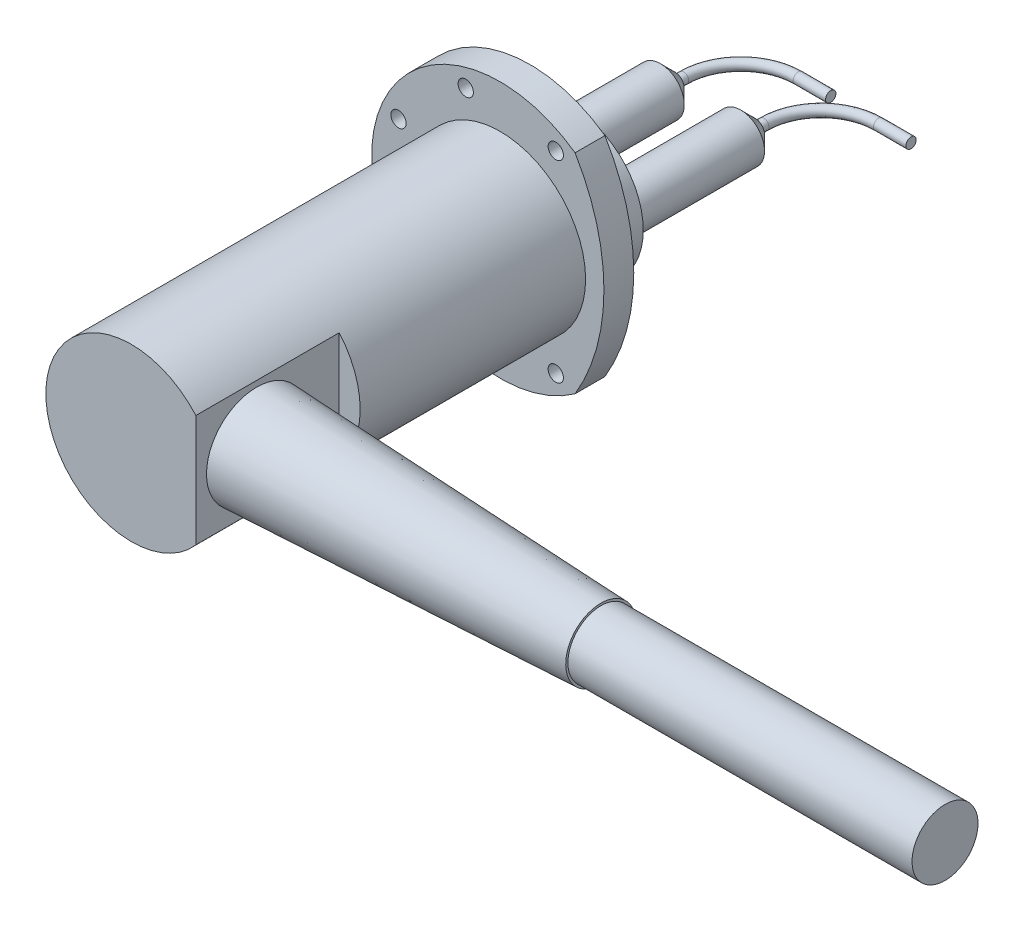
ISO-10303-21;
HEADER;
FILE_DESCRIPTION(('STEP AP214'),'2;1');
FILE_NAME('part.step','',(''),(''),'','','');
FILE_SCHEMA(('AUTOMOTIVE_DESIGN { 1 0 10303 214 1 1 1 1 }'));
ENDSEC;
DATA;
#1=APPLICATION_CONTEXT('core data for automotive mechanical design processes');
#2=APPLICATION_PROTOCOL_DEFINITION('international standard','automotive_design',2000,#1);
#3=PRODUCT_CONTEXT('',#1,'mechanical');
#4=PRODUCT('Part','Part','',(#3));
#5=PRODUCT_RELATED_PRODUCT_CATEGORY('part','',(#4));
#6=PRODUCT_DEFINITION_FORMATION('','',#4);
#7=PRODUCT_DEFINITION_CONTEXT('part definition',#1,'design');
#8=PRODUCT_DEFINITION('design','',#6,#7);
#9=PRODUCT_DEFINITION_SHAPE('','',#8);
#10=(LENGTH_UNIT() NAMED_UNIT(*) SI_UNIT(.MILLI.,.METRE.));
#11=(NAMED_UNIT(*) PLANE_ANGLE_UNIT() SI_UNIT($,.RADIAN.));
#12=(NAMED_UNIT(*) SI_UNIT($,.STERADIAN.) SOLID_ANGLE_UNIT());
#13=UNCERTAINTY_MEASURE_WITH_UNIT(LENGTH_MEASURE(1.E-05),#10,'distance_accuracy_value','');
#14=(GEOMETRIC_REPRESENTATION_CONTEXT(3) GLOBAL_UNCERTAINTY_ASSIGNED_CONTEXT((#13)) GLOBAL_UNIT_ASSIGNED_CONTEXT((#10,
#11,#12)) REPRESENTATION_CONTEXT('',''));
#15=CARTESIAN_POINT('',(0.,0.,0.));
#16=DIRECTION('',(0.,0.,1.));
#17=DIRECTION('',(1.,0.,0.));
#18=AXIS2_PLACEMENT_3D('',#15,#16,#17);
#19=CARTESIAN_POINT('',(17.78,1.94289029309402E-13,-81.9404));
#20=DIRECTION('',(0.,0.,1.));
#21=DIRECTION('',(1.,0.,0.));
#22=AXIS2_PLACEMENT_3D('',#19,#20,#21);
#23=CYLINDRICAL_SURFACE('',#22,10.5075892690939);
#24=CARTESIAN_POINT('',(17.78,1.94289029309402E-13,-75.5903999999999));
#25=DIRECTION('',(0.,0.,-1.));
#26=DIRECTION('',(-1.,0.,0.));
#27=AXIS2_PLACEMENT_3D('',#24,#25,#26);
#28=CIRCLE('',#27,10.5075892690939);
#29=CARTESIAN_POINT('',(28.287589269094,1.94289029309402E-13,-75.5904));
#30=VERTEX_POINT('',#29);
#31=EDGE_CURVE('E11',#30,#30,#28,.F.);
#32=ORIENTED_EDGE('',*,*,#31,.T.);
#33=EDGE_LOOP('',(#32));
#34=FACE_BOUND('',#33,.T.);
#35=CARTESIAN_POINT('',(17.78,0.,-18.4404));
#36=DIRECTION('',(0.,0.,-1.));
#37=DIRECTION('',(-1.,0.,0.));
#38=AXIS2_PLACEMENT_3D('',#35,#36,#37);
#39=CIRCLE('',#38,10.5075892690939);
#40=CARTESIAN_POINT('',(7.27241073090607,0.,-18.4404));
#41=VERTEX_POINT('',#40);
#42=EDGE_CURVE('E402',#41,#41,#39,.T.);
#43=ORIENTED_EDGE('',*,*,#42,.T.);
#44=EDGE_LOOP('',(#43));
#45=FACE_BOUND('',#44,.T.);
#46=ADVANCED_FACE('F392',(#34,#45),#23,.T.);
#47=CARTESIAN_POINT('',(17.78,1.94289029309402E-13,-81.9404));
#48=DIRECTION('',(0.,0.,-1.));
#49=DIRECTION('',(-1.,0.,0.));
#50=AXIS2_PLACEMENT_3D('',#47,#48,#49);
#51=PLANE('',#50);
#52=CARTESIAN_POINT('',(17.78,1.94289029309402E-13,-81.9404));
#53=DIRECTION('',(0.,0.,-1.));
#54=DIRECTION('',(-1.,0.,0.));
#55=AXIS2_PLACEMENT_3D('',#52,#53,#54);
#56=CIRCLE('',#55,4.15758926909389);
#57=CARTESIAN_POINT('',(21.9375892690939,1.94289029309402E-13,-81.9404));
#58=VERTEX_POINT('',#57);
#59=EDGE_CURVE('E398',#58,#58,#56,.T.);
#60=ORIENTED_EDGE('',*,*,#59,.T.);
#61=EDGE_LOOP('',(#60));
#62=FACE_BOUND('',#61,.T.);
#63=ADVANCED_FACE('F413',(#62),#51,.T.);
#64=CARTESIAN_POINT('',(17.78,0.,-18.4404));
#65=DIRECTION('',(0.,0.,-1.));
#66=DIRECTION('',(-1.,0.,0.));
#67=AXIS2_PLACEMENT_3D('',#64,#65,#66);
#68=PLANE('',#67);
#69=ORIENTED_EDGE('',*,*,#42,.F.);
#70=EDGE_LOOP('',(#69));
#71=FACE_BOUND('',#70,.T.);
#72=ADVANCED_FACE('F410',(#71),#68,.F.);
#73=CARTESIAN_POINT('',(17.78,1.94289029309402E-13,-81.9404));
#74=DIRECTION('',(0.,0.,1.));
#75=DIRECTION('',(1.,0.,0.));
#76=AXIS2_PLACEMENT_3D('',#73,#74,#75);
#77=CONICAL_SURFACE('',#76,4.15758926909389,0.785398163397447);
#78=CARTESIAN_POINT('',(28.287589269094,1.94289029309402E-13,-75.5904));
#79=CARTESIAN_POINT('',(28.2214434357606,1.94289029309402E-13,-75.6565458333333));
#80=CARTESIAN_POINT('',(28.1552976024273,1.94289029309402E-13,-75.7226916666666));
#81=CARTESIAN_POINT('',(28.0230059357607,1.94289029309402E-13,-75.8549833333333));
#82=CARTESIAN_POINT('',(27.9568601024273,1.94289029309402E-13,-75.9211291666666));
#83=CARTESIAN_POINT('',(27.8245684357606,1.94289029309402E-13,-76.0534208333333));
#84=CARTESIAN_POINT('',(27.7584226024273,1.94289029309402E-13,-76.1195666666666));
#85=CARTESIAN_POINT('',(27.6261309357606,1.94289029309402E-13,-76.2518583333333));
#86=CARTESIAN_POINT('',(27.5599851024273,1.94289029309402E-13,-76.3180041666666));
#87=CARTESIAN_POINT('',(27.4276934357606,1.94289029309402E-13,-76.4502958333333));
#88=CARTESIAN_POINT('',(27.3615476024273,1.94289029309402E-13,-76.5164416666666));
#89=CARTESIAN_POINT('',(27.2292559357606,1.94289029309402E-13,-76.6487333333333));
#90=CARTESIAN_POINT('',(27.1631101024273,1.94289029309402E-13,-76.7148791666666));
#91=CARTESIAN_POINT('',(27.0308184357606,1.94289029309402E-13,-76.8471708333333));
#92=CARTESIAN_POINT('',(26.9646726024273,1.94289029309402E-13,-76.9133166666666));
#93=CARTESIAN_POINT('',(26.8323809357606,1.94289029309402E-13,-77.0456083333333));
#94=CARTESIAN_POINT('',(26.7662351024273,1.94289029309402E-13,-77.1117541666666));
#95=CARTESIAN_POINT('',(26.6339434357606,1.94289029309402E-13,-77.2440458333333));
#96=CARTESIAN_POINT('',(26.5677976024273,1.94289029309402E-13,-77.3101916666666));
#97=CARTESIAN_POINT('',(26.4355059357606,1.94289029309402E-13,-77.4424833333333));
#98=CARTESIAN_POINT('',(26.3693601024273,1.94289029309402E-13,-77.5086291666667));
#99=CARTESIAN_POINT('',(26.2370684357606,1.94289029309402E-13,-77.6409208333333));
#100=CARTESIAN_POINT('',(26.1709226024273,1.94289029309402E-13,-77.7070666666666));
#101=CARTESIAN_POINT('',(26.0386309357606,1.94289029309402E-13,-77.8393583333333));
#102=CARTESIAN_POINT('',(25.9724851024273,1.94289029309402E-13,-77.9055041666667));
#103=CARTESIAN_POINT('',(25.8401934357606,1.94289029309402E-13,-78.0377958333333));
#104=CARTESIAN_POINT('',(25.7740476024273,1.94289029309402E-13,-78.1039416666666));
#105=CARTESIAN_POINT('',(25.6417559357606,1.94289029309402E-13,-78.2362333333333));
#106=CARTESIAN_POINT('',(25.5756101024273,1.94289029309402E-13,-78.3023791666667));
#107=CARTESIAN_POINT('',(25.4433184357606,1.94289029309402E-13,-78.4346708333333));
#108=CARTESIAN_POINT('',(25.3771726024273,1.94289029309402E-13,-78.5008166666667));
#109=CARTESIAN_POINT('',(25.2448809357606,1.94289029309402E-13,-78.6331083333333));
#110=CARTESIAN_POINT('',(25.1787351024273,1.94289029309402E-13,-78.6992541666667));
#111=CARTESIAN_POINT('',(25.0464434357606,1.94289029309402E-13,-78.8315458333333));
#112=CARTESIAN_POINT('',(24.9802976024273,1.94289029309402E-13,-78.8976916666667));
#113=CARTESIAN_POINT('',(24.8480059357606,1.94289029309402E-13,-79.0299833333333));
#114=CARTESIAN_POINT('',(24.7818601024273,1.94289029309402E-13,-79.0961291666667));
#115=CARTESIAN_POINT('',(24.6495684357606,1.94289029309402E-13,-79.2284208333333));
#116=CARTESIAN_POINT('',(24.5834226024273,1.94289029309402E-13,-79.2945666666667));
#117=CARTESIAN_POINT('',(24.4511309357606,1.94289029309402E-13,-79.4268583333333));
#118=CARTESIAN_POINT('',(24.3849851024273,1.94289029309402E-13,-79.4930041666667));
#119=CARTESIAN_POINT('',(24.2526934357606,1.94289029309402E-13,-79.6252958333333));
#120=CARTESIAN_POINT('',(24.1865476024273,1.94289029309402E-13,-79.6914416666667));
#121=CARTESIAN_POINT('',(24.0542559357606,1.94289029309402E-13,-79.8237333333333));
#122=CARTESIAN_POINT('',(23.9881101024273,1.94289029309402E-13,-79.8898791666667));
#123=CARTESIAN_POINT('',(23.8558184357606,1.94289029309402E-13,-80.0221708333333));
#124=CARTESIAN_POINT('',(23.7896726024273,1.94289029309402E-13,-80.0883166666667));
#125=CARTESIAN_POINT('',(23.6573809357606,1.94289029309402E-13,-80.2206083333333));
#126=CARTESIAN_POINT('',(23.5912351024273,1.94289029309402E-13,-80.2867541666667));
#127=CARTESIAN_POINT('',(23.4589434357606,1.94289029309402E-13,-80.4190458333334));
#128=CARTESIAN_POINT('',(23.3927976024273,1.94289029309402E-13,-80.4851916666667));
#129=CARTESIAN_POINT('',(23.2605059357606,1.94289029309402E-13,-80.6174833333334));
#130=CARTESIAN_POINT('',(23.1943601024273,1.94289029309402E-13,-80.6836291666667));
#131=CARTESIAN_POINT('',(23.0620684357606,1.94289029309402E-13,-80.8159208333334));
#132=CARTESIAN_POINT('',(22.9959226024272,1.94289029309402E-13,-80.8820666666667));
#133=CARTESIAN_POINT('',(22.8636309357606,1.94289029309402E-13,-81.0143583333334));
#134=CARTESIAN_POINT('',(22.7974851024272,1.94289029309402E-13,-81.0805041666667));
#135=CARTESIAN_POINT('',(22.6651934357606,1.94289029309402E-13,-81.2127958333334));
#136=CARTESIAN_POINT('',(22.5990476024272,1.94289029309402E-13,-81.2789416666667));
#137=CARTESIAN_POINT('',(22.4667559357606,1.94289029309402E-13,-81.4112333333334));
#138=CARTESIAN_POINT('',(22.4006101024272,1.94289029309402E-13,-81.4773791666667));
#139=CARTESIAN_POINT('',(22.2683184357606,1.94289029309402E-13,-81.6096708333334));
#140=CARTESIAN_POINT('',(22.2021726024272,1.94289029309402E-13,-81.6758166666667));
#141=CARTESIAN_POINT('',(22.0698809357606,1.94289029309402E-13,-81.8081083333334));
#142=CARTESIAN_POINT('',(22.0037351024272,1.94289029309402E-13,-81.8742541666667));
#143=CARTESIAN_POINT('',(21.9375892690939,1.94289029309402E-13,-81.9404));
#144=B_SPLINE_CURVE_WITH_KNOTS('',3,(#78,#79,#80,#81,#82,#83,#84,#85,#86,#87,#88,#89,#90,#91,
#92,#93,#94,#95,#96,#97,#98,#99,#100,#101,#102,#103,#104,#105,#106,#107,#108,#109,#110,#111,
#112,#113,#114,#115,#116,#117,#118,#119,#120,#121,#122,#123,#124,#125,#126,#127,#128,#129,#130,
#131,#132,#133,#134,#135,#136,#137,#138,#139,#140,#141,#142,#143),.UNSPECIFIED.,.F.,.F.,(4,2,2,
2,2,2,2,2,2,2,2,2,2,2,2,2,2,2,2,2,2,2,2,2,2,2,2,2,2,2,2,2,4),(0.,0.28063300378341,
0.561266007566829,0.841899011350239,1.12253201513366,1.40316501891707,1.68379802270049,
1.9644310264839,2.24506403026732,2.52569703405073,2.80633003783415,3.08696304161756,
3.36759604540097,3.64822904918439,3.92886205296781,4.20949505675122,4.49012806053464,
4.77076106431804,5.05139406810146,5.33202707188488,5.6126600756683,5.89329307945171,
6.17392608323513,6.45455908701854,6.73519209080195,7.01582509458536,7.29645809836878,
7.57709110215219,7.85772410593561,8.13835710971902,8.41899011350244,8.69962311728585,
8.98025612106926),.UNSPECIFIED.);
#145=EDGE_CURVE('BSEAM412',#30,#58,#144,.T.);
#146=ORIENTED_EDGE('',*,*,#31,.F.);
#147=ORIENTED_EDGE('',*,*,#59,.F.);
#148=ORIENTED_EDGE('',*,*,#145,.T.);
#149=ORIENTED_EDGE('',*,*,#145,.F.);
#150=EDGE_LOOP('',(#146,#148,#147,#149));
#151=FACE_BOUND('',#150,.T.);
#152=ADVANCED_FACE('F412',(#151),#77,.T.);
#153=CLOSED_SHELL('',(#46,#63,#72,#152));
#154=MANIFOLD_SOLID_BREP('B2',#153);
#155=CARTESIAN_POINT('',(43.1800000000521,0.,-111.196033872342));
#156=DIRECTION('',(1.,0.,0.));
#157=DIRECTION('',(0.,0.,-1.));
#158=AXIS2_PLACEMENT_3D('',#155,#156,#157);
#159=CYLINDRICAL_SURFACE('',#158,2.286);
#160=CARTESIAN_POINT('',(43.1800000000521,0.,-111.196033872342));
#161=DIRECTION('',(1.,0.,2.05074273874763E-12));
#162=DIRECTION('',(2.05074273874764E-12,0.,-1.));
#163=AXIS2_PLACEMENT_3D('',#160,#161,#162);
#164=CIRCLE('',#163,2.286);
#165=CARTESIAN_POINT('',(43.1800000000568,0.,-113.482033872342));
#166=VERTEX_POINT('',#165);
#167=EDGE_CURVE('E451',#166,#166,#164,.T.);
#168=ORIENTED_EDGE('',*,*,#167,.T.);
#169=EDGE_LOOP('',(#168));
#170=FACE_BOUND('',#169,.T.);
#171=CARTESIAN_POINT('',(57.5485022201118,0.,-111.196033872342));
#172=DIRECTION('',(1.,0.,2.05074273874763E-12));
#173=DIRECTION('',(2.05074273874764E-12,0.,-1.));
#174=AXIS2_PLACEMENT_3D('',#171,#172,#173);
#175=CIRCLE('',#174,2.286);
#176=CARTESIAN_POINT('',(57.5485022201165,0.,-113.482033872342));
#177=VERTEX_POINT('',#176);
#178=EDGE_CURVE('E391',#177,#177,#175,.T.);
#179=ORIENTED_EDGE('',*,*,#178,.F.);
#180=EDGE_LOOP('',(#179));
#181=FACE_BOUND('',#180,.T.);
#182=ADVANCED_FACE('F445',(#170,#181),#159,.T.);
#183=CARTESIAN_POINT('',(43.1800000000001,1.94289029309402E-13,-85.7960338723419));
#184=DIRECTION('',(0.,-1.,0.));
#185=DIRECTION('',(0.,0.,-1.));
#186=AXIS2_PLACEMENT_3D('',#183,#184,#185);
#187=TOROIDAL_SURFACE('',#186,25.4,2.286);
#188=CARTESIAN_POINT('',(17.78,1.94289029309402E-13,-85.7960338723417));
#189=DIRECTION('',(0.,0.,-1.));
#190=DIRECTION('',(-1.,0.,0.));
#191=AXIS2_PLACEMENT_3D('',#188,#189,#190);
#192=CIRCLE('',#191,2.286);
#193=CARTESIAN_POINT('',(15.4940000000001,1.94289029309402E-13,-85.7960338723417));
#194=VERTEX_POINT('',#193);
#195=EDGE_CURVE('E455',#194,#194,#192,.T.);
#196=CARTESIAN_POINT('',(43.1800000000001,1.94289029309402E-13,-85.7960338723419));
#197=DIRECTION('',(0.,-1.,0.));
#198=DIRECTION('',(0.,0.,-1.));
#199=AXIS2_PLACEMENT_3D('',#196,#197,#198);
#200=CIRCLE('',#199,27.686);
#201=EDGE_CURVE('',#194,#166,#200,.T.);
#202=ORIENTED_EDGE('',*,*,#195,.T.);
#203=ORIENTED_EDGE('',*,*,#167,.F.);
#204=ORIENTED_EDGE('',*,*,#201,.T.);
#205=ORIENTED_EDGE('',*,*,#201,.F.);
#206=EDGE_LOOP('',(#202,#204,#203,#205));
#207=FACE_BOUND('',#206,.T.);
#208=ADVANCED_FACE('F476',(#207),#187,.T.);
#209=CARTESIAN_POINT('',(17.78,1.94289029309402E-13,-85.7960338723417));
#210=DIRECTION('',(0.,0.,1.));
#211=DIRECTION('',(1.,0.,0.));
#212=AXIS2_PLACEMENT_3D('',#209,#210,#211);
#213=CYLINDRICAL_SURFACE('',#212,2.286);
#214=ORIENTED_EDGE('',*,*,#195,.F.);
#215=EDGE_LOOP('',(#214));
#216=FACE_BOUND('',#215,.T.);
#217=CARTESIAN_POINT('',(17.78,1.94289029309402E-13,-81.9404));
#218=DIRECTION('',(0.,0.,-1.));
#219=DIRECTION('',(-1.,0.,0.));
#220=AXIS2_PLACEMENT_3D('',#217,#218,#219);
#221=CIRCLE('',#220,2.286);
#222=CARTESIAN_POINT('',(15.494,1.94289029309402E-13,-81.9404));
#223=VERTEX_POINT('',#222);
#224=EDGE_CURVE('E459',#223,#223,#221,.T.);
#225=ORIENTED_EDGE('',*,*,#224,.T.);
#226=EDGE_LOOP('',(#225));
#227=FACE_BOUND('',#226,.T.);
#228=ADVANCED_FACE('F465',(#216,#227),#213,.T.);
#229=CARTESIAN_POINT('',(57.5485022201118,0.,-111.196033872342));
#230=DIRECTION('',(1.,0.,2.05074273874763E-12));
#231=DIRECTION('',(2.05074273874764E-12,0.,-1.));
#232=AXIS2_PLACEMENT_3D('',#229,#230,#231);
#233=PLANE('',#232);
#234=ORIENTED_EDGE('',*,*,#178,.T.);
#235=EDGE_LOOP('',(#234));
#236=FACE_BOUND('',#235,.T.);
#237=ADVANCED_FACE('F469',(#236),#233,.T.);
#238=CARTESIAN_POINT('',(17.78,1.94289029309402E-13,-81.9404));
#239=DIRECTION('',(0.,0.,-1.));
#240=DIRECTION('',(-1.,0.,0.));
#241=AXIS2_PLACEMENT_3D('',#238,#239,#240);
#242=PLANE('',#241);
#243=ORIENTED_EDGE('',*,*,#224,.F.);
#244=EDGE_LOOP('',(#243));
#245=FACE_BOUND('',#244,.T.);
#246=ADVANCED_FACE('F467',(#245),#242,.F.);
#247=CLOSED_SHELL('',(#182,#208,#228,#237,#246));
#248=MANIFOLD_SOLID_BREP('B6',#247);
#249=CARTESIAN_POINT('',(7.62000000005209,0.,-111.196033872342));
#250=DIRECTION('',(1.,0.,0.));
#251=DIRECTION('',(0.,0.,-1.));
#252=AXIS2_PLACEMENT_3D('',#249,#250,#251);
#253=CYLINDRICAL_SURFACE('',#252,2.286);
#254=CARTESIAN_POINT('',(7.62000000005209,0.,-111.196033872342));
#255=DIRECTION('',(1.,0.,2.05074273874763E-12));
#256=DIRECTION('',(2.05074273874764E-12,0.,-1.));
#257=AXIS2_PLACEMENT_3D('',#254,#255,#256);
#258=CIRCLE('',#257,2.286);
#259=CARTESIAN_POINT('',(7.62000000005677,0.,-113.482033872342));
#260=VERTEX_POINT('',#259);
#261=EDGE_CURVE('E512',#260,#260,#258,.T.);
#262=ORIENTED_EDGE('',*,*,#261,.T.);
#263=EDGE_LOOP('',(#262));
#264=FACE_BOUND('',#263,.T.);
#265=CARTESIAN_POINT('',(21.9885022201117,0.,-111.196033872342));
#266=DIRECTION('',(1.,0.,2.05074273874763E-12));
#267=DIRECTION('',(2.05074273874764E-12,0.,-1.));
#268=AXIS2_PLACEMENT_3D('',#265,#266,#267);
#269=CIRCLE('',#268,2.286);
#270=CARTESIAN_POINT('',(21.9885022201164,0.,-113.482033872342));
#271=VERTEX_POINT('',#270);
#272=EDGE_CURVE('E444',#271,#271,#269,.T.);
#273=ORIENTED_EDGE('',*,*,#272,.F.);
#274=EDGE_LOOP('',(#273));
#275=FACE_BOUND('',#274,.T.);
#276=ADVANCED_FACE('F506',(#264,#275),#253,.T.);
#277=CARTESIAN_POINT('',(7.62,1.94289029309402E-13,-85.7960338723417));
#278=DIRECTION('',(0.,-1.,0.));
#279=DIRECTION('',(0.,0.,-1.));
#280=AXIS2_PLACEMENT_3D('',#277,#278,#279);
#281=TOROIDAL_SURFACE('',#280,25.4,2.286);
#282=CARTESIAN_POINT('',(-17.78,1.94289029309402E-13,-85.7960338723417));
#283=DIRECTION('',(0.,0.,-1.));
#284=DIRECTION('',(-1.,0.,0.));
#285=AXIS2_PLACEMENT_3D('',#282,#283,#284);
#286=CIRCLE('',#285,2.286);
#287=CARTESIAN_POINT('',(-20.066,1.94289029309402E-13,-85.7960338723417));
#288=VERTEX_POINT('',#287);
#289=EDGE_CURVE('E516',#288,#288,#286,.T.);
#290=CARTESIAN_POINT('',(7.62,1.94289029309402E-13,-85.7960338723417));
#291=DIRECTION('',(0.,-1.,0.));
#292=DIRECTION('',(0.,0.,-1.));
#293=AXIS2_PLACEMENT_3D('',#290,#291,#292);
#294=CIRCLE('',#293,27.686);
#295=EDGE_CURVE('',#288,#260,#294,.T.);
#296=ORIENTED_EDGE('',*,*,#289,.T.);
#297=ORIENTED_EDGE('',*,*,#261,.F.);
#298=ORIENTED_EDGE('',*,*,#295,.T.);
#299=ORIENTED_EDGE('',*,*,#295,.F.);
#300=EDGE_LOOP('',(#296,#298,#297,#299));
#301=FACE_BOUND('',#300,.T.);
#302=ADVANCED_FACE('F537',(#301),#281,.T.);
#303=CARTESIAN_POINT('',(-17.78,1.94289029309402E-13,-85.7960338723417));
#304=DIRECTION('',(0.,0.,1.));
#305=DIRECTION('',(1.,0.,0.));
#306=AXIS2_PLACEMENT_3D('',#303,#304,#305);
#307=CYLINDRICAL_SURFACE('',#306,2.286);
#308=ORIENTED_EDGE('',*,*,#289,.F.);
#309=EDGE_LOOP('',(#308));
#310=FACE_BOUND('',#309,.T.);
#311=CARTESIAN_POINT('',(-17.78,1.94289029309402E-13,-81.9404));
#312=DIRECTION('',(0.,0.,-1.));
#313=DIRECTION('',(-1.,0.,0.));
#314=AXIS2_PLACEMENT_3D('',#311,#312,#313);
#315=CIRCLE('',#314,2.286);
#316=CARTESIAN_POINT('',(-20.066,1.94289029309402E-13,-81.9404));
#317=VERTEX_POINT('',#316);
#318=EDGE_CURVE('E520',#317,#317,#315,.T.);
#319=ORIENTED_EDGE('',*,*,#318,.T.);
#320=EDGE_LOOP('',(#319));
#321=FACE_BOUND('',#320,.T.);
#322=ADVANCED_FACE('F526',(#310,#321),#307,.T.);
#323=CARTESIAN_POINT('',(21.9885022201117,0.,-111.196033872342));
#324=DIRECTION('',(1.,0.,2.05074273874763E-12));
#325=DIRECTION('',(2.05074273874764E-12,0.,-1.));
#326=AXIS2_PLACEMENT_3D('',#323,#324,#325);
#327=PLANE('',#326);
#328=ORIENTED_EDGE('',*,*,#272,.T.);
#329=EDGE_LOOP('',(#328));
#330=FACE_BOUND('',#329,.T.);
#331=ADVANCED_FACE('F530',(#330),#327,.T.);
#332=CARTESIAN_POINT('',(-17.78,1.94289029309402E-13,-81.9404));
#333=DIRECTION('',(0.,0.,-1.));
#334=DIRECTION('',(-1.,0.,0.));
#335=AXIS2_PLACEMENT_3D('',#332,#333,#334);
#336=PLANE('',#335);
#337=ORIENTED_EDGE('',*,*,#318,.F.);
#338=EDGE_LOOP('',(#337));
#339=FACE_BOUND('',#338,.T.);
#340=ADVANCED_FACE('F528',(#339),#336,.F.);
#341=CLOSED_SHELL('',(#276,#302,#322,#331,#340));
#342=MANIFOLD_SOLID_BREP('B386',#341);
#343=CARTESIAN_POINT('',(-17.78,1.94289029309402E-13,-81.9404));
#344=DIRECTION('',(0.,0.,1.));
#345=DIRECTION('',(1.,0.,0.));
#346=AXIS2_PLACEMENT_3D('',#343,#344,#345);
#347=CYLINDRICAL_SURFACE('',#346,10.5075892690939);
#348=CARTESIAN_POINT('',(-17.78,1.94289029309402E-13,-75.5903999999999));
#349=DIRECTION('',(0.,0.,-1.));
#350=DIRECTION('',(-1.,0.,0.));
#351=AXIS2_PLACEMENT_3D('',#348,#349,#350);
#352=CIRCLE('',#351,10.5075892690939);
#353=CARTESIAN_POINT('',(-7.27241073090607,1.94289029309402E-13,-75.5904));
#354=VERTEX_POINT('',#353);
#355=EDGE_CURVE('E505',#354,#354,#352,.F.);
#356=ORIENTED_EDGE('',*,*,#355,.T.);
#357=EDGE_LOOP('',(#356));
#358=FACE_BOUND('',#357,.T.);
#359=CARTESIAN_POINT('',(-17.78,0.,-18.4404));
#360=DIRECTION('',(0.,0.,-1.));
#361=DIRECTION('',(-1.,0.,0.));
#362=AXIS2_PLACEMENT_3D('',#359,#360,#361);
#363=CIRCLE('',#362,10.5075892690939);
#364=CARTESIAN_POINT('',(-28.287589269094,0.,-18.4404));
#365=VERTEX_POINT('',#364);
#366=EDGE_CURVE('E580',#365,#365,#363,.T.);
#367=ORIENTED_EDGE('',*,*,#366,.T.);
#368=EDGE_LOOP('',(#367));
#369=FACE_BOUND('',#368,.T.);
#370=ADVANCED_FACE('F570',(#358,#369),#347,.T.);
#371=CARTESIAN_POINT('',(-17.78,1.94289029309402E-13,-81.9404));
#372=DIRECTION('',(0.,0.,-1.));
#373=DIRECTION('',(-1.,0.,0.));
#374=AXIS2_PLACEMENT_3D('',#371,#372,#373);
#375=PLANE('',#374);
#376=CARTESIAN_POINT('',(-17.78,1.94289029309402E-13,-81.9404));
#377=DIRECTION('',(0.,0.,-1.));
#378=DIRECTION('',(-1.,0.,0.));
#379=AXIS2_PLACEMENT_3D('',#376,#377,#378);
#380=CIRCLE('',#379,4.15758926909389);
#381=CARTESIAN_POINT('',(-13.6224107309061,1.94289029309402E-13,-81.9404));
#382=VERTEX_POINT('',#381);
#383=EDGE_CURVE('E576',#382,#382,#380,.T.);
#384=ORIENTED_EDGE('',*,*,#383,.T.);
#385=EDGE_LOOP('',(#384));
#386=FACE_BOUND('',#385,.T.);
#387=ADVANCED_FACE('F591',(#386),#375,.T.);
#388=CARTESIAN_POINT('',(-17.78,0.,-18.4404));
#389=DIRECTION('',(0.,0.,-1.));
#390=DIRECTION('',(-1.,0.,0.));
#391=AXIS2_PLACEMENT_3D('',#388,#389,#390);
#392=PLANE('',#391);
#393=ORIENTED_EDGE('',*,*,#366,.F.);
#394=EDGE_LOOP('',(#393));
#395=FACE_BOUND('',#394,.T.);
#396=ADVANCED_FACE('F588',(#395),#392,.F.);
#397=CARTESIAN_POINT('',(-17.78,1.94289029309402E-13,-81.9404));
#398=DIRECTION('',(0.,0.,1.));
#399=DIRECTION('',(1.,0.,0.));
#400=AXIS2_PLACEMENT_3D('',#397,#398,#399);
#401=CONICAL_SURFACE('',#400,4.15758926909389,0.785398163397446);
#402=CARTESIAN_POINT('',(-7.27241073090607,1.94289029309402E-13,-75.5904));
#403=CARTESIAN_POINT('',(-7.3385565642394,1.94289029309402E-13,-75.6565458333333));
#404=CARTESIAN_POINT('',(-7.40470239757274,1.94289029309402E-13,-75.7226916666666));
#405=CARTESIAN_POINT('',(-7.5369940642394,1.94289029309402E-13,-75.8549833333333));
#406=CARTESIAN_POINT('',(-7.60313989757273,1.94289029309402E-13,-75.9211291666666));
#407=CARTESIAN_POINT('',(-7.7354315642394,1.94289029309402E-13,-76.0534208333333));
#408=CARTESIAN_POINT('',(-7.80157739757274,1.94289029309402E-13,-76.1195666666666));
#409=CARTESIAN_POINT('',(-7.93386906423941,1.94289029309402E-13,-76.2518583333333));
#410=CARTESIAN_POINT('',(-8.00001489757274,1.94289029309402E-13,-76.3180041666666));
#411=CARTESIAN_POINT('',(-8.13230656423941,1.94289029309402E-13,-76.4502958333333));
#412=CARTESIAN_POINT('',(-8.19845239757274,1.94289029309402E-13,-76.5164416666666));
#413=CARTESIAN_POINT('',(-8.33074406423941,1.94289029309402E-13,-76.6487333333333));
#414=CARTESIAN_POINT('',(-8.39688989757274,1.94289029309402E-13,-76.7148791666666));
#415=CARTESIAN_POINT('',(-8.52918156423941,1.94289029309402E-13,-76.8471708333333));
#416=CARTESIAN_POINT('',(-8.59532739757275,1.94289029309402E-13,-76.9133166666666));
#417=CARTESIAN_POINT('',(-8.72761906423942,1.94289029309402E-13,-77.0456083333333));
#418=CARTESIAN_POINT('',(-8.79376489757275,1.94289029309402E-13,-77.1117541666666));
#419=CARTESIAN_POINT('',(-8.92605656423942,1.94289029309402E-13,-77.2440458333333));
#420=CARTESIAN_POINT('',(-8.99220239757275,1.94289029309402E-13,-77.3101916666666));
#421=CARTESIAN_POINT('',(-9.12449406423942,1.94289029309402E-13,-77.4424833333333));
#422=CARTESIAN_POINT('',(-9.19063989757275,1.94289029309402E-13,-77.5086291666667));
#423=CARTESIAN_POINT('',(-9.32293156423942,1.94289029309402E-13,-77.6409208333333));
#424=CARTESIAN_POINT('',(-9.38907739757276,1.94289029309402E-13,-77.7070666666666));
#425=CARTESIAN_POINT('',(-9.52136906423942,1.94289029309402E-13,-77.8393583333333));
#426=CARTESIAN_POINT('',(-9.58751489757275,1.94289029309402E-13,-77.9055041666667));
#427=CARTESIAN_POINT('',(-9.71980656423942,1.94289029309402E-13,-78.0377958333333));
#428=CARTESIAN_POINT('',(-9.78595239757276,1.94289029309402E-13,-78.1039416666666));
#429=CARTESIAN_POINT('',(-9.91824406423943,1.94289029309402E-13,-78.2362333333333));
#430=CARTESIAN_POINT('',(-9.98438989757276,1.94289029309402E-13,-78.3023791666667));
#431=CARTESIAN_POINT('',(-10.1166815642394,1.94289029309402E-13,-78.4346708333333));
#432=CARTESIAN_POINT('',(-10.1828273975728,1.94289029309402E-13,-78.5008166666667));
#433=CARTESIAN_POINT('',(-10.3151190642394,1.94289029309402E-13,-78.6331083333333));
#434=CARTESIAN_POINT('',(-10.3812648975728,1.94289029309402E-13,-78.6992541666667));
#435=CARTESIAN_POINT('',(-10.5135565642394,1.94289029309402E-13,-78.8315458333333));
#436=CARTESIAN_POINT('',(-10.5797023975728,1.94289029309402E-13,-78.8976916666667));
#437=CARTESIAN_POINT('',(-10.7119940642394,1.94289029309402E-13,-79.0299833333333));
#438=CARTESIAN_POINT('',(-10.7781398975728,1.94289029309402E-13,-79.0961291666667));
#439=CARTESIAN_POINT('',(-10.9104315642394,1.94289029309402E-13,-79.2284208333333));
#440=CARTESIAN_POINT('',(-10.9765773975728,1.94289029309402E-13,-79.2945666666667));
#441=CARTESIAN_POINT('',(-11.1088690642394,1.94289029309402E-13,-79.4268583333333));
#442=CARTESIAN_POINT('',(-11.1750148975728,1.94289029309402E-13,-79.4930041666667));
#443=CARTESIAN_POINT('',(-11.3073065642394,1.94289029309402E-13,-79.6252958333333));
#444=CARTESIAN_POINT('',(-11.3734523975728,1.94289029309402E-13,-79.6914416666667));
#445=CARTESIAN_POINT('',(-11.5057440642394,1.94289029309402E-13,-79.8237333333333));
#446=CARTESIAN_POINT('',(-11.5718898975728,1.94289029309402E-13,-79.8898791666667));
#447=CARTESIAN_POINT('',(-11.7041815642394,1.94289029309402E-13,-80.0221708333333));
#448=CARTESIAN_POINT('',(-11.7703273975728,1.94289029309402E-13,-80.0883166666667));
#449=CARTESIAN_POINT('',(-11.9026190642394,1.94289029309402E-13,-80.2206083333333));
#450=CARTESIAN_POINT('',(-11.9687648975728,1.94289029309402E-13,-80.2867541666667));
#451=CARTESIAN_POINT('',(-12.1010565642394,1.94289029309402E-13,-80.4190458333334));
#452=CARTESIAN_POINT('',(-12.1672023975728,1.94289029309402E-13,-80.4851916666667));
#453=CARTESIAN_POINT('',(-12.2994940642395,1.94289029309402E-13,-80.6174833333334));
#454=CARTESIAN_POINT('',(-12.3656398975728,1.94289029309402E-13,-80.6836291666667));
#455=CARTESIAN_POINT('',(-12.4979315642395,1.94289029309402E-13,-80.8159208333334));
#456=CARTESIAN_POINT('',(-12.5640773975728,1.94289029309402E-13,-80.8820666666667));
#457=CARTESIAN_POINT('',(-12.6963690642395,1.94289029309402E-13,-81.0143583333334));
#458=CARTESIAN_POINT('',(-12.7625148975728,1.94289029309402E-13,-81.0805041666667));
#459=CARTESIAN_POINT('',(-12.8948065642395,1.94289029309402E-13,-81.2127958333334));
#460=CARTESIAN_POINT('',(-12.9609523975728,1.94289029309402E-13,-81.2789416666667));
#461=CARTESIAN_POINT('',(-13.0932440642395,1.94289029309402E-13,-81.4112333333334));
#462=CARTESIAN_POINT('',(-13.1593898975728,1.94289029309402E-13,-81.4773791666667));
#463=CARTESIAN_POINT('',(-13.2916815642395,1.94289029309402E-13,-81.6096708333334));
#464=CARTESIAN_POINT('',(-13.3578273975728,1.94289029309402E-13,-81.6758166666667));
#465=CARTESIAN_POINT('',(-13.4901190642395,1.94289029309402E-13,-81.8081083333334));
#466=CARTESIAN_POINT('',(-13.5562648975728,1.94289029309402E-13,-81.8742541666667));
#467=CARTESIAN_POINT('',(-13.6224107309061,1.94289029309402E-13,-81.9404));
#468=B_SPLINE_CURVE_WITH_KNOTS('',3,(#402,#403,#404,#405,#406,#407,#408,#409,#410,#411,#412,
#413,#414,#415,#416,#417,#418,#419,#420,#421,#422,#423,#424,#425,#426,#427,#428,#429,#430,#431,
#432,#433,#434,#435,#436,#437,#438,#439,#440,#441,#442,#443,#444,#445,#446,#447,#448,#449,#450,
#451,#452,#453,#454,#455,#456,#457,#458,#459,#460,#461,#462,#463,#464,#465,#466,#467),
.UNSPECIFIED.,.F.,.F.,(4,2,2,2,2,2,2,2,2,2,2,2,2,2,2,2,2,2,2,2,2,2,2,2,2,2,2,2,2,2,2,2,4),(0.,
0.28063300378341,0.561266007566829,0.841899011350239,1.12253201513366,1.40316501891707,
1.68379802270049,1.9644310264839,2.24506403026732,2.52569703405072,2.80633003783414,
3.08696304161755,3.36759604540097,3.64822904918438,3.9288620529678,4.20949505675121,
4.49012806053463,4.77076106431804,5.05139406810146,5.33202707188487,5.61266007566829,
5.89329307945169,6.17392608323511,6.45455908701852,6.73519209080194,7.01582509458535,
7.29645809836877,7.57709110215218,7.8577241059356,8.13835710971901,8.41899011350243,
8.69962311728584,8.98025612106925),.UNSPECIFIED.);
#469=EDGE_CURVE('BSEAM590',#354,#382,#468,.T.);
#470=ORIENTED_EDGE('',*,*,#355,.F.);
#471=ORIENTED_EDGE('',*,*,#383,.F.);
#472=ORIENTED_EDGE('',*,*,#469,.T.);
#473=ORIENTED_EDGE('',*,*,#469,.F.);
#474=EDGE_LOOP('',(#470,#472,#471,#473));
#475=FACE_BOUND('',#474,.T.);
#476=ADVANCED_FACE('F590',(#475),#401,.T.);
#477=CLOSED_SHELL('',(#370,#387,#396,#476));
#478=MANIFOLD_SOLID_BREP('B439',#477);
#479=CARTESIAN_POINT('',(180.975,0.,149.574825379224));
#480=DIRECTION('',(1.,0.,0.));
#481=DIRECTION('',(0.,1.,0.));
#482=AXIS2_PLACEMENT_3D('',#479,#480,#481);
#483=PLANE('',#482);
#484=CARTESIAN_POINT('',(180.975,0.,149.574825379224));
#485=DIRECTION('',(1.,0.,0.));
#486=DIRECTION('',(0.,1.,0.));
#487=AXIS2_PLACEMENT_3D('',#484,#485,#486);
#488=CIRCLE('',#487,15.5710723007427);
#489=CARTESIAN_POINT('',(180.975,15.5710723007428,149.574825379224));
#490=VERTEX_POINT('',#489);
#491=EDGE_CURVE('E780',#490,#490,#488,.T.);
#492=ORIENTED_EDGE('',*,*,#491,.T.);
#493=EDGE_LOOP('',(#492));
#494=FACE_BOUND('',#493,.T.);
#495=CARTESIAN_POINT('',(180.975,0.,149.574825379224));
#496=DIRECTION('',(1.,0.,0.));
#497=DIRECTION('',(0.,1.,0.));
#498=AXIS2_PLACEMENT_3D('',#495,#496,#497);
#499=CIRCLE('',#498,14.605);
#500=CARTESIAN_POINT('',(180.975,14.6050000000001,149.574825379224));
#501=VERTEX_POINT('',#500);
#502=EDGE_CURVE('E870',#501,#501,#499,.T.);
#503=ORIENTED_EDGE('',*,*,#502,.F.);
#504=EDGE_LOOP('',(#503));
#505=FACE_BOUND('',#504,.T.);
#506=ADVANCED_FACE('F615',(#494,#505),#483,.T.);
#507=CARTESIAN_POINT('',(28.575,34.0880174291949,113.03));
#508=DIRECTION('',(-1.,0.,0.));
#509=DIRECTION('',(0.,-1.,0.));
#510=AXIS2_PLACEMENT_3D('',#507,#508,#509);
#511=PLANE('',#510);
#512=DIRECTION('',(0.,-1.,0.));
#513=VECTOR('',#512,1.);
#514=CARTESIAN_POINT('',(28.5750000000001,0.,176.53));
#515=LINE('',#514,#513);
#516=CARTESIAN_POINT('',(28.5750000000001,24.8150980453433,176.53));
#517=VERTEX_POINT('',#516);
#518=CARTESIAN_POINT('',(28.5750000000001,-24.8150980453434,176.53));
#519=VERTEX_POINT('',#518);
#520=EDGE_CURVE('E671',#517,#519,#515,.T.);
#521=ORIENTED_EDGE('',*,*,#520,.T.);
#522=DIRECTION('',(0.,0.,-1.));
#523=VECTOR('',#522,1.);
#524=CARTESIAN_POINT('',(28.5750000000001,-24.8150980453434,176.53));
#525=LINE('',#524,#523);
#526=CARTESIAN_POINT('',(28.575,-24.8150980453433,113.03));
#527=VERTEX_POINT('',#526);
#528=EDGE_CURVE('E779',#527,#519,#525,.F.);
#529=ORIENTED_EDGE('',*,*,#528,.F.);
#530=DIRECTION('',(0.,-1.,0.));
#531=VECTOR('',#530,1.);
#532=CARTESIAN_POINT('',(28.575,34.0880174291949,113.03));
#533=LINE('',#532,#531);
#534=CARTESIAN_POINT('',(28.575,24.8150980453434,113.03));
#535=VERTEX_POINT('',#534);
#536=EDGE_CURVE('E778',#535,#527,#533,.T.);
#537=ORIENTED_EDGE('',*,*,#536,.F.);
#538=DIRECTION('',(0.,0.,-1.));
#539=VECTOR('',#538,1.);
#540=CARTESIAN_POINT('',(28.5750000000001,24.8150980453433,176.53));
#541=LINE('',#540,#539);
#542=EDGE_CURVE('E638',#517,#535,#541,.T.);
#543=ORIENTED_EDGE('',*,*,#542,.F.);
#544=EDGE_LOOP('',(#521,#529,#537,#543));
#545=FACE_BOUND('',#544,.T.);
#546=CARTESIAN_POINT('',(28.575,0.,149.574825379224));
#547=DIRECTION('',(-1.,0.,0.));
#548=DIRECTION('',(0.,-1.,0.));
#549=AXIS2_PLACEMENT_3D('',#546,#547,#548);
#550=CIRCLE('',#549,22.225);
#551=CARTESIAN_POINT('',(28.575,-22.225,149.574825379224));
#552=VERTEX_POINT('',#551);
#553=EDGE_CURVE('E681',#552,#552,#550,.F.);
#554=ORIENTED_EDGE('',*,*,#553,.F.);
#555=EDGE_LOOP('',(#554));
#556=FACE_BOUND('',#555,.T.);
#557=ADVANCED_FACE('F687',(#545,#556),#511,.F.);
#558=CARTESIAN_POINT('',(0.,0.,0.));
#559=DIRECTION('',(0.,0.,1.));
#560=DIRECTION('',(1.,0.,0.));
#561=AXIS2_PLACEMENT_3D('',#558,#559,#560);
#562=PLANE('',#561);
#563=CARTESIAN_POINT('',(0.,0.,0.));
#564=DIRECTION('',(0.,0.,1.));
#565=DIRECTION('',(1.,0.,0.));
#566=AXIS2_PLACEMENT_3D('',#563,#564,#565);
#567=CIRCLE('',#566,56.896);
#568=CARTESIAN_POINT('',(33.1895780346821,46.212625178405,0.));
#569=VERTEX_POINT('',#568);
#570=CARTESIAN_POINT('',(33.1895780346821,-46.2126251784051,0.));
#571=VERTEX_POINT('',#570);
#572=EDGE_CURVE('E668',#569,#571,#567,.T.);
#573=ORIENTED_EDGE('',*,*,#572,.F.);
#574=CARTESIAN_POINT('',(-43.942,0.,0.));
#575=DIRECTION('',(0.,0.,1.));
#576=DIRECTION('',(1.,0.,0.));
#577=AXIS2_PLACEMENT_3D('',#574,#575,#576);
#578=CIRCLE('',#577,89.916);
#579=EDGE_CURVE('E656',#569,#571,#578,.F.);
#580=ORIENTED_EDGE('',*,*,#579,.T.);
#581=EDGE_LOOP('',(#573,#580));
#582=FACE_BOUND('',#581,.T.);
#583=CARTESIAN_POINT('',(24.6380000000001,42.674267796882,0.));
#584=DIRECTION('',(0.,0.,1.));
#585=DIRECTION('',(1.,0.,0.));
#586=AXIS2_PLACEMENT_3D('',#583,#584,#585);
#587=CIRCLE('',#586,3.3782);
#588=CARTESIAN_POINT('',(28.0162000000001,42.674267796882,0.));
#589=VERTEX_POINT('',#588);
#590=EDGE_CURVE('E825',#589,#589,#587,.T.);
#591=ORIENTED_EDGE('',*,*,#590,.T.);
#592=EDGE_LOOP('',(#591));
#593=FACE_BOUND('',#592,.T.);
#594=CARTESIAN_POINT('',(-15.2271214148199,46.86426089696,0.));
#595=DIRECTION('',(0.,0.,1.));
#596=DIRECTION('',(1.,0.,0.));
#597=AXIS2_PLACEMENT_3D('',#594,#595,#596);
#598=CIRCLE('',#597,3.3782);
#599=CARTESIAN_POINT('',(-11.8489214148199,46.86426089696,0.));
#600=VERTEX_POINT('',#599);
#601=EDGE_CURVE('E819',#600,#600,#598,.T.);
#602=ORIENTED_EDGE('',*,*,#601,.T.);
#603=EDGE_LOOP('',(#602));
#604=FACE_BOUND('',#603,.T.);
#605=CARTESIAN_POINT('',(-45.0158659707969,20.042354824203,0.));
#606=DIRECTION('',(0.,0.,1.));
#607=DIRECTION('',(1.,0.,0.));
#608=AXIS2_PLACEMENT_3D('',#605,#606,#607);
#609=CIRCLE('',#608,3.3782);
#610=CARTESIAN_POINT('',(-41.6376659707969,20.042354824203,0.));
#611=VERTEX_POINT('',#610);
#612=EDGE_CURVE('E813',#611,#611,#609,.T.);
#613=ORIENTED_EDGE('',*,*,#612,.T.);
#614=EDGE_LOOP('',(#613));
#615=FACE_BOUND('',#614,.T.);
#616=CARTESIAN_POINT('',(-45.0158659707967,-20.0423548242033,0.));
#617=DIRECTION('',(0.,0.,1.));
#618=DIRECTION('',(1.,0.,0.));
#619=AXIS2_PLACEMENT_3D('',#616,#617,#618);
#620=CIRCLE('',#619,3.3782);
#621=CARTESIAN_POINT('',(-41.6376659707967,-20.0423548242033,0.));
#622=VERTEX_POINT('',#621);
#623=EDGE_CURVE('E807',#622,#622,#620,.T.);
#624=ORIENTED_EDGE('',*,*,#623,.T.);
#625=EDGE_LOOP('',(#624));
#626=FACE_BOUND('',#625,.T.);
#627=CARTESIAN_POINT('',(-15.2271214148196,-46.8642608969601,0.));
#628=DIRECTION('',(0.,0.,1.));
#629=DIRECTION('',(1.,0.,0.));
#630=AXIS2_PLACEMENT_3D('',#627,#628,#629);
#631=CIRCLE('',#630,3.3782);
#632=CARTESIAN_POINT('',(-11.8489214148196,-46.8642608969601,0.));
#633=VERTEX_POINT('',#632);
#634=EDGE_CURVE('E801',#633,#633,#631,.T.);
#635=ORIENTED_EDGE('',*,*,#634,.T.);
#636=EDGE_LOOP('',(#635));
#637=FACE_BOUND('',#636,.T.);
#638=CARTESIAN_POINT('',(24.6379999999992,-42.6742677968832,0.));
#639=DIRECTION('',(0.,0.,1.));
#640=DIRECTION('',(1.,0.,0.));
#641=AXIS2_PLACEMENT_3D('',#638,#639,#640);
#642=CIRCLE('',#641,3.37819999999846);
#643=CARTESIAN_POINT('',(28.0161999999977,-42.6742677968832,0.));
#644=VERTEX_POINT('',#643);
#645=EDGE_CURVE('E795',#644,#644,#642,.T.);
#646=ORIENTED_EDGE('',*,*,#645,.T.);
#647=EDGE_LOOP('',(#646));
#648=FACE_BOUND('',#647,.T.);
#649=CARTESIAN_POINT('',(0.,0.,0.));
#650=DIRECTION('',(0.,0.,1.));
#651=DIRECTION('',(1.,0.,0.));
#652=AXIS2_PLACEMENT_3D('',#649,#650,#651);
#653=CIRCLE('',#652,31.7246);
#654=CARTESIAN_POINT('',(31.7246000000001,0.,0.));
#655=VERTEX_POINT('',#654);
#656=EDGE_CURVE('E667',#655,#655,#653,.F.);
#657=ORIENTED_EDGE('',*,*,#656,.F.);
#658=EDGE_LOOP('',(#657));
#659=FACE_BOUND('',#658,.T.);
#660=ADVANCED_FACE('F689',(#582,#593,#604,#615,#626,#637,#648,#659),#562,.F.);
#661=CARTESIAN_POINT('',(0.,0.,13.2080000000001));
#662=DIRECTION('',(0.,0.,1.));
#663=DIRECTION('',(1.,0.,0.));
#664=AXIS2_PLACEMENT_3D('',#661,#662,#663);
#665=PLANE('',#664);
#666=CARTESIAN_POINT('',(-43.942,0.,13.208));
#667=DIRECTION('',(0.,0.,-1.));
#668=DIRECTION('',(1.,0.,0.));
#669=AXIS2_PLACEMENT_3D('',#666,#667,#668);
#670=CIRCLE('',#669,89.916);
#671=CARTESIAN_POINT('',(33.1895780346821,46.212625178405,13.208));
#672=VERTEX_POINT('',#671);
#673=CARTESIAN_POINT('',(33.189578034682,-46.2126251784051,13.208));
#674=VERTEX_POINT('',#673);
#675=EDGE_CURVE('E630',#672,#674,#670,.T.);
#676=ORIENTED_EDGE('',*,*,#675,.F.);
#677=CARTESIAN_POINT('',(0.,0.,13.2080000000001));
#678=DIRECTION('',(0.,0.,1.));
#679=DIRECTION('',(1.,0.,0.));
#680=AXIS2_PLACEMENT_3D('',#677,#678,#679);
#681=CIRCLE('',#680,56.896);
#682=EDGE_CURVE('E665',#672,#674,#681,.T.);
#683=ORIENTED_EDGE('',*,*,#682,.T.);
#684=EDGE_LOOP('',(#676,#683));
#685=FACE_BOUND('',#684,.T.);
#686=CARTESIAN_POINT('',(24.6379999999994,-42.6742677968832,13.208));
#687=DIRECTION('',(0.,0.,1.));
#688=DIRECTION('',(1.,0.,0.));
#689=AXIS2_PLACEMENT_3D('',#686,#687,#688);
#690=CIRCLE('',#689,3.37819999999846);
#691=CARTESIAN_POINT('',(28.0161999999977,-42.6742677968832,13.208));
#692=VERTEX_POINT('',#691);
#693=EDGE_CURVE('E789',#692,#692,#690,.T.);
#694=ORIENTED_EDGE('',*,*,#693,.F.);
#695=EDGE_LOOP('',(#694));
#696=FACE_BOUND('',#695,.T.);
#697=CARTESIAN_POINT('',(-15.2271214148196,-46.8642608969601,13.208));
#698=DIRECTION('',(0.,0.,1.));
#699=DIRECTION('',(1.,0.,0.));
#700=AXIS2_PLACEMENT_3D('',#697,#698,#699);
#701=CIRCLE('',#700,3.3782);
#702=CARTESIAN_POINT('',(-11.8489214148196,-46.8642608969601,13.208));
#703=VERTEX_POINT('',#702);
#704=EDGE_CURVE('E798',#703,#703,#701,.T.);
#705=ORIENTED_EDGE('',*,*,#704,.F.);
#706=EDGE_LOOP('',(#705));
#707=FACE_BOUND('',#706,.T.);
#708=CARTESIAN_POINT('',(-45.0158659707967,-20.0423548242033,13.208));
#709=DIRECTION('',(0.,0.,1.));
#710=DIRECTION('',(1.,0.,0.));
#711=AXIS2_PLACEMENT_3D('',#708,#709,#710);
#712=CIRCLE('',#711,3.3782);
#713=CARTESIAN_POINT('',(-41.6376659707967,-20.0423548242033,13.208));
#714=VERTEX_POINT('',#713);
#715=EDGE_CURVE('E804',#714,#714,#712,.T.);
#716=ORIENTED_EDGE('',*,*,#715,.F.);
#717=EDGE_LOOP('',(#716));
#718=FACE_BOUND('',#717,.T.);
#719=CARTESIAN_POINT('',(-45.0158659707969,20.042354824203,13.208));
#720=DIRECTION('',(0.,0.,1.));
#721=DIRECTION('',(1.,0.,0.));
#722=AXIS2_PLACEMENT_3D('',#719,#720,#721);
#723=CIRCLE('',#722,3.3782);
#724=CARTESIAN_POINT('',(-41.6376659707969,20.042354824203,13.208));
#725=VERTEX_POINT('',#724);
#726=EDGE_CURVE('E810',#725,#725,#723,.T.);
#727=ORIENTED_EDGE('',*,*,#726,.F.);
#728=EDGE_LOOP('',(#727));
#729=FACE_BOUND('',#728,.T.);
#730=CARTESIAN_POINT('',(-15.2271214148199,46.86426089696,13.208));
#731=DIRECTION('',(0.,0.,1.));
#732=DIRECTION('',(1.,0.,0.));
#733=AXIS2_PLACEMENT_3D('',#730,#731,#732);
#734=CIRCLE('',#733,3.3782);
#735=CARTESIAN_POINT('',(-11.8489214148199,46.86426089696,13.208));
#736=VERTEX_POINT('',#735);
#737=EDGE_CURVE('E816',#736,#736,#734,.T.);
#738=ORIENTED_EDGE('',*,*,#737,.F.);
#739=EDGE_LOOP('',(#738));
#740=FACE_BOUND('',#739,.T.);
#741=CARTESIAN_POINT('',(24.6380000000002,42.674267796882,13.208));
#742=DIRECTION('',(0.,0.,1.));
#743=DIRECTION('',(1.,0.,0.));
#744=AXIS2_PLACEMENT_3D('',#741,#742,#743);
#745=CIRCLE('',#744,3.3782);
#746=CARTESIAN_POINT('',(28.0162000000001,42.674267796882,13.208));
#747=VERTEX_POINT('',#746);
#748=EDGE_CURVE('E822',#747,#747,#745,.T.);
#749=ORIENTED_EDGE('',*,*,#748,.F.);
#750=EDGE_LOOP('',(#749));
#751=FACE_BOUND('',#750,.T.);
#752=CARTESIAN_POINT('',(0.,0.,13.2080000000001));
#753=DIRECTION('',(0.,0.,1.));
#754=DIRECTION('',(1.,0.,0.));
#755=AXIS2_PLACEMENT_3D('',#752,#753,#754);
#756=CIRCLE('',#755,37.846);
#757=CARTESIAN_POINT('',(37.8460000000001,0.,13.2080000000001));
#758=VERTEX_POINT('',#757);
#759=EDGE_CURVE('E828',#758,#758,#756,.T.);
#760=ORIENTED_EDGE('',*,*,#759,.F.);
#761=EDGE_LOOP('',(#760));
#762=FACE_BOUND('',#761,.T.);
#763=ADVANCED_FACE('F663',(#685,#696,#707,#718,#729,#740,#751,#762),#665,.T.);
#764=CARTESIAN_POINT('',(0.,0.,13.2080000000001));
#765=DIRECTION('',(0.,0.,-1.));
#766=DIRECTION('',(-1.,0.,0.));
#767=AXIS2_PLACEMENT_3D('',#764,#765,#766);
#768=CYLINDRICAL_SURFACE('',#767,56.896);
#769=ORIENTED_EDGE('',*,*,#682,.F.);
#770=DIRECTION('',(0.,0.,1.));
#771=VECTOR('',#770,1.);
#772=CARTESIAN_POINT('',(33.1895780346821,46.212625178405,6.604));
#773=LINE('',#772,#771);
#774=EDGE_CURVE('E568',#672,#569,#773,.F.);
#775=ORIENTED_EDGE('',*,*,#774,.T.);
#776=ORIENTED_EDGE('',*,*,#572,.T.);
#777=DIRECTION('',(0.,0.,1.));
#778=VECTOR('',#777,1.);
#779=CARTESIAN_POINT('',(33.1895780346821,-46.212625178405,6.60400000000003));
#780=LINE('',#779,#778);
#781=EDGE_CURVE('E623',#571,#674,#780,.T.);
#782=ORIENTED_EDGE('',*,*,#781,.T.);
#783=EDGE_LOOP('',(#769,#775,#776,#782));
#784=FACE_BOUND('',#783,.T.);
#785=ADVANCED_FACE('F617',(#784),#768,.T.);
#786=CARTESIAN_POINT('',(-1.38777878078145E-13,0.,176.53));
#787=DIRECTION('',(0.,0.,-1.));
#788=DIRECTION('',(-1.,0.,0.));
#789=AXIS2_PLACEMENT_3D('',#786,#787,#788);
#790=CYLINDRICAL_SURFACE('',#789,37.846);
#791=CARTESIAN_POINT('',(-1.38777878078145E-13,0.,176.53));
#792=DIRECTION('',(0.,0.,1.));
#793=DIRECTION('',(1.,0.,0.));
#794=AXIS2_PLACEMENT_3D('',#791,#792,#793);
#795=CIRCLE('',#794,37.846);
#796=EDGE_CURVE('E673',#517,#519,#795,.T.);
#797=ORIENTED_EDGE('',*,*,#796,.F.);
#798=ORIENTED_EDGE('',*,*,#542,.T.);
#799=CARTESIAN_POINT('',(0.,0.,113.03));
#800=DIRECTION('',(0.,0.,-1.));
#801=DIRECTION('',(-1.,0.,0.));
#802=AXIS2_PLACEMENT_3D('',#799,#800,#801);
#803=CIRCLE('',#802,37.846);
#804=EDGE_CURVE('E678',#535,#527,#803,.T.);
#805=ORIENTED_EDGE('',*,*,#804,.T.);
#806=ORIENTED_EDGE('',*,*,#528,.T.);
#807=EDGE_LOOP('',(#797,#798,#805,#806));
#808=FACE_BOUND('',#807,.T.);
#809=ORIENTED_EDGE('',*,*,#759,.T.);
#810=EDGE_LOOP('',(#809));
#811=FACE_BOUND('',#810,.T.);
#812=ADVANCED_FACE('F740',(#808,#811),#790,.T.);
#813=CARTESIAN_POINT('',(-1.38777878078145E-13,0.,176.53));
#814=DIRECTION('',(0.,0.,1.));
#815=DIRECTION('',(1.,0.,0.));
#816=AXIS2_PLACEMENT_3D('',#813,#814,#815);
#817=PLANE('',#816);
#818=ORIENTED_EDGE('',*,*,#520,.F.);
#819=ORIENTED_EDGE('',*,*,#796,.T.);
#820=EDGE_LOOP('',(#818,#819));
#821=FACE_BOUND('',#820,.T.);
#822=ADVANCED_FACE('F736',(#821),#817,.T.);
#823=CARTESIAN_POINT('',(24.6380000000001,42.674267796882,0.));
#824=DIRECTION('',(0.,0.,1.));
#825=DIRECTION('',(1.,0.,0.));
#826=AXIS2_PLACEMENT_3D('',#823,#824,#825);
#827=CYLINDRICAL_SURFACE('',#826,3.3782);
#828=CARTESIAN_POINT('',(28.0162000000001,42.674267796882,0.));
#829=CARTESIAN_POINT('',(28.0162000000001,42.674267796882,0.137583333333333));
#830=CARTESIAN_POINT('',(28.0162000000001,42.674267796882,0.275166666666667));
#831=CARTESIAN_POINT('',(28.0162000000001,42.674267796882,0.550333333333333));
#832=CARTESIAN_POINT('',(28.0162000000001,42.674267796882,0.687916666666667));
#833=CARTESIAN_POINT('',(28.0162000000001,42.674267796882,0.963083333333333));
#834=CARTESIAN_POINT('',(28.0162000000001,42.674267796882,1.10066666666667));
#835=CARTESIAN_POINT('',(28.0162000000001,42.674267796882,1.37583333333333));
#836=CARTESIAN_POINT('',(28.0162000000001,42.674267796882,1.51341666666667));
#837=CARTESIAN_POINT('',(28.0162000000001,42.674267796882,1.78858333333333));
#838=CARTESIAN_POINT('',(28.0162000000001,42.674267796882,1.92616666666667));
#839=CARTESIAN_POINT('',(28.0162000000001,42.674267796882,2.20133333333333));
#840=CARTESIAN_POINT('',(28.0162000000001,42.674267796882,2.33891666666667));
#841=CARTESIAN_POINT('',(28.0162000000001,42.674267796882,2.61408333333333));
#842=CARTESIAN_POINT('',(28.0162000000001,42.674267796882,2.75166666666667));
#843=CARTESIAN_POINT('',(28.0162000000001,42.674267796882,3.02683333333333));
#844=CARTESIAN_POINT('',(28.0162000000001,42.674267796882,3.16441666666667));
#845=CARTESIAN_POINT('',(28.0162000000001,42.674267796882,3.43958333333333));
#846=CARTESIAN_POINT('',(28.0162000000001,42.674267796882,3.57716666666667));
#847=CARTESIAN_POINT('',(28.0162000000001,42.674267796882,3.85233333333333));
#848=CARTESIAN_POINT('',(28.0162000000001,42.674267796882,3.98991666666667));
#849=CARTESIAN_POINT('',(28.0162000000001,42.674267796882,4.26508333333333));
#850=CARTESIAN_POINT('',(28.0162000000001,42.674267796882,4.40266666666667));
#851=CARTESIAN_POINT('',(28.0162000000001,42.674267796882,4.67783333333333));
#852=CARTESIAN_POINT('',(28.0162000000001,42.674267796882,4.81541666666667));
#853=CARTESIAN_POINT('',(28.0162000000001,42.674267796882,5.09058333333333));
#854=CARTESIAN_POINT('',(28.0162000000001,42.674267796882,5.22816666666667));
#855=CARTESIAN_POINT('',(28.0162000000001,42.674267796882,5.50333333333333));
#856=CARTESIAN_POINT('',(28.0162000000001,42.674267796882,5.64091666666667));
#857=CARTESIAN_POINT('',(28.0162000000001,42.674267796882,5.91608333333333));
#858=CARTESIAN_POINT('',(28.0162000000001,42.674267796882,6.05366666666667));
#859=CARTESIAN_POINT('',(28.0162000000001,42.674267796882,6.32883333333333));
#860=CARTESIAN_POINT('',(28.0162000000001,42.674267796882,6.46641666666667));
#861=CARTESIAN_POINT('',(28.0162000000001,42.674267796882,6.74158333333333));
#862=CARTESIAN_POINT('',(28.0162000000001,42.674267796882,6.87916666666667));
#863=CARTESIAN_POINT('',(28.0162000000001,42.674267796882,7.15433333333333));
#864=CARTESIAN_POINT('',(28.0162000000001,42.674267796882,7.29191666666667));
#865=CARTESIAN_POINT('',(28.0162000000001,42.674267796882,7.56708333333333));
#866=CARTESIAN_POINT('',(28.0162000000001,42.674267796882,7.70466666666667));
#867=CARTESIAN_POINT('',(28.0162000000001,42.674267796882,7.97983333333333));
#868=CARTESIAN_POINT('',(28.0162000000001,42.674267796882,8.11741666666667));
#869=CARTESIAN_POINT('',(28.0162000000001,42.674267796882,8.39258333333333));
#870=CARTESIAN_POINT('',(28.0162000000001,42.674267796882,8.53016666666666));
#871=CARTESIAN_POINT('',(28.0162000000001,42.674267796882,8.80533333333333));
#872=CARTESIAN_POINT('',(28.0162000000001,42.674267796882,8.94291666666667));
#873=CARTESIAN_POINT('',(28.0162000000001,42.674267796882,9.21808333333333));
#874=CARTESIAN_POINT('',(28.0162000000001,42.674267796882,9.35566666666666));
#875=CARTESIAN_POINT('',(28.0162000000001,42.674267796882,9.63083333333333));
#876=CARTESIAN_POINT('',(28.0162000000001,42.674267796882,9.76841666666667));
#877=CARTESIAN_POINT('',(28.0162000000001,42.674267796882,10.0435833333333));
#878=CARTESIAN_POINT('',(28.0162000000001,42.674267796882,10.1811666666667));
#879=CARTESIAN_POINT('',(28.0162000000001,42.674267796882,10.4563333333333));
#880=CARTESIAN_POINT('',(28.0162000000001,42.674267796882,10.5939166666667));
#881=CARTESIAN_POINT('',(28.0162000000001,42.674267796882,10.8690833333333));
#882=CARTESIAN_POINT('',(28.0162000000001,42.674267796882,11.0066666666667));
#883=CARTESIAN_POINT('',(28.0162000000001,42.674267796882,11.2818333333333));
#884=CARTESIAN_POINT('',(28.0162000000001,42.674267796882,11.4194166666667));
#885=CARTESIAN_POINT('',(28.0162000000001,42.674267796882,11.6945833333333));
#886=CARTESIAN_POINT('',(28.0162000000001,42.674267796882,11.8321666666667));
#887=CARTESIAN_POINT('',(28.0162000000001,42.674267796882,12.1073333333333));
#888=CARTESIAN_POINT('',(28.0162000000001,42.674267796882,12.2449166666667));
#889=CARTESIAN_POINT('',(28.0162000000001,42.674267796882,12.5200833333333));
#890=CARTESIAN_POINT('',(28.0162000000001,42.674267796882,12.6576666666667));
#891=CARTESIAN_POINT('',(28.0162000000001,42.674267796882,12.9328333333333));
#892=CARTESIAN_POINT('',(28.0162000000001,42.674267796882,13.0704166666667));
#893=CARTESIAN_POINT('',(28.0162000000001,42.674267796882,13.208));
#894=B_SPLINE_CURVE_WITH_KNOTS('',3,(#828,#829,#830,#831,#832,#833,#834,#835,#836,#837,#838,
#839,#840,#841,#842,#843,#844,#845,#846,#847,#848,#849,#850,#851,#852,#853,#854,#855,#856,#857,
#858,#859,#860,#861,#862,#863,#864,#865,#866,#867,#868,#869,#870,#871,#872,#873,#874,#875,#876,
#877,#878,#879,#880,#881,#882,#883,#884,#885,#886,#887,#888,#889,#890,#891,#892,#893),
.UNSPECIFIED.,.F.,.F.,(4,2,2,2,2,2,2,2,2,2,2,2,2,2,2,2,2,2,2,2,2,2,2,2,2,2,2,2,2,2,2,2,4),(0.,
0.41275,0.8255,1.23825,1.651,2.06375,2.4765,2.88925,3.302,3.71475,4.1275,4.54025,4.953,5.36575,
5.7785,6.19125,6.604,7.01675,7.4295,7.84225,8.255,8.66775,9.0805,9.49325,9.906,10.31875,10.7315,
11.14425,11.557,11.96975,12.3825,12.79525,13.208),.UNSPECIFIED.);
#895=EDGE_CURVE('BSEAM732',#589,#747,#894,.T.);
#896=ORIENTED_EDGE('',*,*,#590,.F.);
#897=ORIENTED_EDGE('',*,*,#748,.T.);
#898=ORIENTED_EDGE('',*,*,#895,.T.);
#899=ORIENTED_EDGE('',*,*,#895,.F.);
#900=EDGE_LOOP('',(#896,#898,#897,#899));
#901=FACE_BOUND('',#900,.T.);
#902=ADVANCED_FACE('F732',(#901),#827,.F.);
#903=CARTESIAN_POINT('',(-15.2271214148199,46.86426089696,0.));
#904=DIRECTION('',(0.,0.,1.));
#905=DIRECTION('',(1.,0.,0.));
#906=AXIS2_PLACEMENT_3D('',#903,#904,#905);
#907=CYLINDRICAL_SURFACE('',#906,3.3782);
#908=CARTESIAN_POINT('',(-11.8489214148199,46.86426089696,0.));
#909=CARTESIAN_POINT('',(-11.8489214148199,46.86426089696,0.137583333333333));
#910=CARTESIAN_POINT('',(-11.8489214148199,46.86426089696,0.275166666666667));
#911=CARTESIAN_POINT('',(-11.8489214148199,46.86426089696,0.550333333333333));
#912=CARTESIAN_POINT('',(-11.8489214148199,46.86426089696,0.687916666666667));
#913=CARTESIAN_POINT('',(-11.8489214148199,46.86426089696,0.963083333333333));
#914=CARTESIAN_POINT('',(-11.8489214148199,46.86426089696,1.10066666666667));
#915=CARTESIAN_POINT('',(-11.8489214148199,46.86426089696,1.37583333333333));
#916=CARTESIAN_POINT('',(-11.8489214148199,46.86426089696,1.51341666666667));
#917=CARTESIAN_POINT('',(-11.8489214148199,46.86426089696,1.78858333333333));
#918=CARTESIAN_POINT('',(-11.8489214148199,46.86426089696,1.92616666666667));
#919=CARTESIAN_POINT('',(-11.8489214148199,46.86426089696,2.20133333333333));
#920=CARTESIAN_POINT('',(-11.8489214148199,46.86426089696,2.33891666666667));
#921=CARTESIAN_POINT('',(-11.8489214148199,46.86426089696,2.61408333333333));
#922=CARTESIAN_POINT('',(-11.8489214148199,46.86426089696,2.75166666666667));
#923=CARTESIAN_POINT('',(-11.8489214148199,46.86426089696,3.02683333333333));
#924=CARTESIAN_POINT('',(-11.8489214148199,46.86426089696,3.16441666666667));
#925=CARTESIAN_POINT('',(-11.8489214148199,46.86426089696,3.43958333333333));
#926=CARTESIAN_POINT('',(-11.8489214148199,46.86426089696,3.57716666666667));
#927=CARTESIAN_POINT('',(-11.8489214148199,46.86426089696,3.85233333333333));
#928=CARTESIAN_POINT('',(-11.8489214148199,46.86426089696,3.98991666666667));
#929=CARTESIAN_POINT('',(-11.8489214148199,46.86426089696,4.26508333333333));
#930=CARTESIAN_POINT('',(-11.8489214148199,46.86426089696,4.40266666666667));
#931=CARTESIAN_POINT('',(-11.8489214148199,46.86426089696,4.67783333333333));
#932=CARTESIAN_POINT('',(-11.8489214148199,46.86426089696,4.81541666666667));
#933=CARTESIAN_POINT('',(-11.8489214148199,46.86426089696,5.09058333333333));
#934=CARTESIAN_POINT('',(-11.8489214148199,46.86426089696,5.22816666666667));
#935=CARTESIAN_POINT('',(-11.8489214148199,46.86426089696,5.50333333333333));
#936=CARTESIAN_POINT('',(-11.8489214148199,46.86426089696,5.64091666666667));
#937=CARTESIAN_POINT('',(-11.8489214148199,46.86426089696,5.91608333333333));
#938=CARTESIAN_POINT('',(-11.8489214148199,46.86426089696,6.05366666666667));
#939=CARTESIAN_POINT('',(-11.8489214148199,46.86426089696,6.32883333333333));
#940=CARTESIAN_POINT('',(-11.8489214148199,46.86426089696,6.46641666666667));
#941=CARTESIAN_POINT('',(-11.8489214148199,46.86426089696,6.74158333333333));
#942=CARTESIAN_POINT('',(-11.8489214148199,46.86426089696,6.87916666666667));
#943=CARTESIAN_POINT('',(-11.8489214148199,46.86426089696,7.15433333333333));
#944=CARTESIAN_POINT('',(-11.8489214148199,46.86426089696,7.29191666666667));
#945=CARTESIAN_POINT('',(-11.8489214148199,46.86426089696,7.56708333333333));
#946=CARTESIAN_POINT('',(-11.8489214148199,46.86426089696,7.70466666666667));
#947=CARTESIAN_POINT('',(-11.8489214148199,46.86426089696,7.97983333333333));
#948=CARTESIAN_POINT('',(-11.8489214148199,46.86426089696,8.11741666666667));
#949=CARTESIAN_POINT('',(-11.8489214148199,46.86426089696,8.39258333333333));
#950=CARTESIAN_POINT('',(-11.8489214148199,46.86426089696,8.53016666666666));
#951=CARTESIAN_POINT('',(-11.8489214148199,46.86426089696,8.80533333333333));
#952=CARTESIAN_POINT('',(-11.8489214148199,46.86426089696,8.94291666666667));
#953=CARTESIAN_POINT('',(-11.8489214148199,46.86426089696,9.21808333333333));
#954=CARTESIAN_POINT('',(-11.8489214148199,46.86426089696,9.35566666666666));
#955=CARTESIAN_POINT('',(-11.8489214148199,46.86426089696,9.63083333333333));
#956=CARTESIAN_POINT('',(-11.8489214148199,46.86426089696,9.76841666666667));
#957=CARTESIAN_POINT('',(-11.8489214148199,46.86426089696,10.0435833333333));
#958=CARTESIAN_POINT('',(-11.8489214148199,46.86426089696,10.1811666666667));
#959=CARTESIAN_POINT('',(-11.8489214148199,46.86426089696,10.4563333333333));
#960=CARTESIAN_POINT('',(-11.8489214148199,46.86426089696,10.5939166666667));
#961=CARTESIAN_POINT('',(-11.8489214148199,46.86426089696,10.8690833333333));
#962=CARTESIAN_POINT('',(-11.8489214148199,46.86426089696,11.0066666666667));
#963=CARTESIAN_POINT('',(-11.8489214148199,46.86426089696,11.2818333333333));
#964=CARTESIAN_POINT('',(-11.8489214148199,46.86426089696,11.4194166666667));
#965=CARTESIAN_POINT('',(-11.8489214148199,46.86426089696,11.6945833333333));
#966=CARTESIAN_POINT('',(-11.8489214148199,46.86426089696,11.8321666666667));
#967=CARTESIAN_POINT('',(-11.8489214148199,46.86426089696,12.1073333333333));
#968=CARTESIAN_POINT('',(-11.8489214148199,46.86426089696,12.2449166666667));
#969=CARTESIAN_POINT('',(-11.8489214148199,46.86426089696,12.5200833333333));
#970=CARTESIAN_POINT('',(-11.8489214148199,46.86426089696,12.6576666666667));
#971=CARTESIAN_POINT('',(-11.8489214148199,46.86426089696,12.9328333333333));
#972=CARTESIAN_POINT('',(-11.8489214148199,46.86426089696,13.0704166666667));
#973=CARTESIAN_POINT('',(-11.8489214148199,46.86426089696,13.208));
#974=B_SPLINE_CURVE_WITH_KNOTS('',3,(#908,#909,#910,#911,#912,#913,#914,#915,#916,#917,#918,
#919,#920,#921,#922,#923,#924,#925,#926,#927,#928,#929,#930,#931,#932,#933,#934,#935,#936,#937,
#938,#939,#940,#941,#942,#943,#944,#945,#946,#947,#948,#949,#950,#951,#952,#953,#954,#955,#956,
#957,#958,#959,#960,#961,#962,#963,#964,#965,#966,#967,#968,#969,#970,#971,#972,#973),
.UNSPECIFIED.,.F.,.F.,(4,2,2,2,2,2,2,2,2,2,2,2,2,2,2,2,2,2,2,2,2,2,2,2,2,2,2,2,2,2,2,2,4),(0.,
0.41275,0.8255,1.23825,1.651,2.06375,2.4765,2.88925,3.302,3.71475,4.1275,4.54025,4.953,5.36575,
5.7785,6.19125,6.604,7.01675,7.4295,7.84225,8.255,8.66775,9.0805,9.49325,9.906,10.31875,10.7315,
11.14425,11.557,11.96975,12.3825,12.79525,13.208),.UNSPECIFIED.);
#975=EDGE_CURVE('BSEAM728',#600,#736,#974,.T.);
#976=ORIENTED_EDGE('',*,*,#601,.F.);
#977=ORIENTED_EDGE('',*,*,#737,.T.);
#978=ORIENTED_EDGE('',*,*,#975,.T.);
#979=ORIENTED_EDGE('',*,*,#975,.F.);
#980=EDGE_LOOP('',(#976,#978,#977,#979));
#981=FACE_BOUND('',#980,.T.);
#982=ADVANCED_FACE('F728',(#981),#907,.F.);
#983=CARTESIAN_POINT('',(-45.0158659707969,20.042354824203,0.));
#984=DIRECTION('',(0.,0.,1.));
#985=DIRECTION('',(1.,0.,0.));
#986=AXIS2_PLACEMENT_3D('',#983,#984,#985);
#987=CYLINDRICAL_SURFACE('',#986,3.3782);
#988=CARTESIAN_POINT('',(-41.6376659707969,20.042354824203,0.));
#989=CARTESIAN_POINT('',(-41.6376659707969,20.042354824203,0.137583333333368));
#990=CARTESIAN_POINT('',(-41.6376659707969,20.042354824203,0.2751666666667));
#991=CARTESIAN_POINT('',(-41.6376659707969,20.042354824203,0.550333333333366));
#992=CARTESIAN_POINT('',(-41.6376659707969,20.042354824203,0.687916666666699));
#993=CARTESIAN_POINT('',(-41.6376659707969,20.042354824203,0.963083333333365));
#994=CARTESIAN_POINT('',(-41.6376659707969,20.042354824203,1.1006666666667));
#995=CARTESIAN_POINT('',(-41.6376659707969,20.042354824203,1.37583333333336));
#996=CARTESIAN_POINT('',(-41.6376659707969,20.042354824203,1.5134166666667));
#997=CARTESIAN_POINT('',(-41.6376659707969,20.042354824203,1.78858333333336));
#998=CARTESIAN_POINT('',(-41.6376659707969,20.042354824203,1.9261666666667));
#999=CARTESIAN_POINT('',(-41.6376659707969,20.042354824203,2.20133333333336));
#1000=CARTESIAN_POINT('',(-41.6376659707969,20.042354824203,2.33891666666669));
#1001=CARTESIAN_POINT('',(-41.6376659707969,20.042354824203,2.61408333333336));
#1002=CARTESIAN_POINT('',(-41.6376659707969,20.042354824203,2.75166666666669));
#1003=CARTESIAN_POINT('',(-41.6376659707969,20.042354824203,3.02683333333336));
#1004=CARTESIAN_POINT('',(-41.6376659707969,20.042354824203,3.16441666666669));
#1005=CARTESIAN_POINT('',(-41.6376659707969,20.042354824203,3.43958333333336));
#1006=CARTESIAN_POINT('',(-41.6376659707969,20.042354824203,3.57716666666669));
#1007=CARTESIAN_POINT('',(-41.6376659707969,20.042354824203,3.85233333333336));
#1008=CARTESIAN_POINT('',(-41.6376659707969,20.042354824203,3.98991666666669));
#1009=CARTESIAN_POINT('',(-41.6376659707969,20.042354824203,4.26508333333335));
#1010=CARTESIAN_POINT('',(-41.6376659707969,20.042354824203,4.40266666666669));
#1011=CARTESIAN_POINT('',(-41.6376659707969,20.042354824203,4.67783333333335));
#1012=CARTESIAN_POINT('',(-41.6376659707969,20.042354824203,4.81541666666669));
#1013=CARTESIAN_POINT('',(-41.6376659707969,20.042354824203,5.09058333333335));
#1014=CARTESIAN_POINT('',(-41.6376659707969,20.042354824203,5.22816666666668));
#1015=CARTESIAN_POINT('',(-41.6376659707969,20.042354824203,5.50333333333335));
#1016=CARTESIAN_POINT('',(-41.6376659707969,20.042354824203,5.64091666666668));
#1017=CARTESIAN_POINT('',(-41.6376659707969,20.042354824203,5.91608333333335));
#1018=CARTESIAN_POINT('',(-41.6376659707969,20.042354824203,6.05366666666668));
#1019=CARTESIAN_POINT('',(-41.6376659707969,20.042354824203,6.32883333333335));
#1020=CARTESIAN_POINT('',(-41.6376659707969,20.042354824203,6.46641666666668));
#1021=CARTESIAN_POINT('',(-41.6376659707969,20.042354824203,6.74158333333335));
#1022=CARTESIAN_POINT('',(-41.6376659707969,20.042354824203,6.87916666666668));
#1023=CARTESIAN_POINT('',(-41.6376659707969,20.042354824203,7.15433333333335));
#1024=CARTESIAN_POINT('',(-41.6376659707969,20.042354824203,7.29191666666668));
#1025=CARTESIAN_POINT('',(-41.6376659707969,20.042354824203,7.56708333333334));
#1026=CARTESIAN_POINT('',(-41.6376659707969,20.042354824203,7.70466666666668));
#1027=CARTESIAN_POINT('',(-41.6376659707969,20.042354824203,7.97983333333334));
#1028=CARTESIAN_POINT('',(-41.6376659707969,20.042354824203,8.11741666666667));
#1029=CARTESIAN_POINT('',(-41.6376659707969,20.042354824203,8.39258333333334));
#1030=CARTESIAN_POINT('',(-41.6376659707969,20.042354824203,8.53016666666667));
#1031=CARTESIAN_POINT('',(-41.6376659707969,20.042354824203,8.80533333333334));
#1032=CARTESIAN_POINT('',(-41.6376659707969,20.042354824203,8.94291666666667));
#1033=CARTESIAN_POINT('',(-41.6376659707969,20.042354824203,9.21808333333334));
#1034=CARTESIAN_POINT('',(-41.6376659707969,20.042354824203,9.35566666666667));
#1035=CARTESIAN_POINT('',(-41.6376659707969,20.042354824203,9.63083333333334));
#1036=CARTESIAN_POINT('',(-41.6376659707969,20.042354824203,9.76841666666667));
#1037=CARTESIAN_POINT('',(-41.6376659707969,20.042354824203,10.0435833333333));
#1038=CARTESIAN_POINT('',(-41.6376659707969,20.042354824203,10.1811666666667));
#1039=CARTESIAN_POINT('',(-41.6376659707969,20.042354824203,10.4563333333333));
#1040=CARTESIAN_POINT('',(-41.6376659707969,20.042354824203,10.5939166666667));
#1041=CARTESIAN_POINT('',(-41.6376659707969,20.042354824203,10.8690833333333));
#1042=CARTESIAN_POINT('',(-41.6376659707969,20.042354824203,11.0066666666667));
#1043=CARTESIAN_POINT('',(-41.6376659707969,20.042354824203,11.2818333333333));
#1044=CARTESIAN_POINT('',(-41.6376659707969,20.042354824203,11.4194166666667));
#1045=CARTESIAN_POINT('',(-41.6376659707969,20.042354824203,11.6945833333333));
#1046=CARTESIAN_POINT('',(-41.6376659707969,20.042354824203,11.8321666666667));
#1047=CARTESIAN_POINT('',(-41.6376659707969,20.042354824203,12.1073333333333));
#1048=CARTESIAN_POINT('',(-41.6376659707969,20.042354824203,12.2449166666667));
#1049=CARTESIAN_POINT('',(-41.6376659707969,20.042354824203,12.5200833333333));
#1050=CARTESIAN_POINT('',(-41.6376659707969,20.042354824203,12.6576666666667));
#1051=CARTESIAN_POINT('',(-41.6376659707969,20.042354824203,12.9328333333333));
#1052=CARTESIAN_POINT('',(-41.6376659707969,20.042354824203,13.0704166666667));
#1053=CARTESIAN_POINT('',(-41.6376659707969,20.042354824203,13.208));
#1054=B_SPLINE_CURVE_WITH_KNOTS('',3,(#988,#989,#990,#991,#992,#993,#994,#995,#996,#997,#998,
#999,#1000,#1001,#1002,#1003,#1004,#1005,#1006,#1007,#1008,#1009,#1010,#1011,#1012,#1013,#1014,
#1015,#1016,#1017,#1018,#1019,#1020,#1021,#1022,#1023,#1024,#1025,#1026,#1027,#1028,#1029,#1030,
#1031,#1032,#1033,#1034,#1035,#1036,#1037,#1038,#1039,#1040,#1041,#1042,#1043,#1044,#1045,#1046,
#1047,#1048,#1049,#1050,#1051,#1052,#1053),.UNSPECIFIED.,.F.,.F.,(4,2,2,2,2,2,2,2,2,2,2,2,2,2,2,
2,2,2,2,2,2,2,2,2,2,2,2,2,2,2,2,2,4),(0.,0.412749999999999,0.825499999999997,1.23825,
1.65099999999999,2.06374999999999,2.47649999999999,2.88924999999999,3.30199999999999,
3.71474999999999,4.12749999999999,4.54024999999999,4.95299999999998,5.36574999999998,
5.77849999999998,6.19124999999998,6.60399999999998,7.01674999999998,7.42949999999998,
7.84224999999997,8.25499999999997,8.66774999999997,9.08049999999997,9.49324999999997,
9.90599999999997,10.31875,10.7315,11.14425,11.557,11.96975,12.3825,12.79525,13.208),.UNSPECIFIED.);
#1055=EDGE_CURVE('BSEAM724',#611,#725,#1054,.T.);
#1056=ORIENTED_EDGE('',*,*,#612,.F.);
#1057=ORIENTED_EDGE('',*,*,#726,.T.);
#1058=ORIENTED_EDGE('',*,*,#1055,.T.);
#1059=ORIENTED_EDGE('',*,*,#1055,.F.);
#1060=EDGE_LOOP('',(#1056,#1058,#1057,#1059));
#1061=FACE_BOUND('',#1060,.T.);
#1062=ADVANCED_FACE('F724',(#1061),#987,.F.);
#1063=CARTESIAN_POINT('',(-45.0158659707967,-20.0423548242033,0.));
#1064=DIRECTION('',(0.,0.,1.));
#1065=DIRECTION('',(1.,0.,0.));
#1066=AXIS2_PLACEMENT_3D('',#1063,#1064,#1065);
#1067=CYLINDRICAL_SURFACE('',#1066,3.3782);
#1068=CARTESIAN_POINT('',(-41.6376659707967,-20.0423548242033,0.));
#1069=CARTESIAN_POINT('',(-41.6376659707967,-20.0423548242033,0.137583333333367));
#1070=CARTESIAN_POINT('',(-41.6376659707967,-20.0423548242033,0.275166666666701));
#1071=CARTESIAN_POINT('',(-41.6376659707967,-20.0423548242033,0.550333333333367));
#1072=CARTESIAN_POINT('',(-41.6376659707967,-20.0423548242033,0.6879166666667));
#1073=CARTESIAN_POINT('',(-41.6376659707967,-20.0423548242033,0.963083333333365));
#1074=CARTESIAN_POINT('',(-41.6376659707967,-20.0423548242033,1.1006666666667));
#1075=CARTESIAN_POINT('',(-41.6376659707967,-20.0423548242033,1.37583333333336));
#1076=CARTESIAN_POINT('',(-41.6376659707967,-20.0423548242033,1.5134166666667));
#1077=CARTESIAN_POINT('',(-41.6376659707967,-20.0423548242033,1.78858333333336));
#1078=CARTESIAN_POINT('',(-41.6376659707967,-20.0423548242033,1.9261666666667));
#1079=CARTESIAN_POINT('',(-41.6376659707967,-20.0423548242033,2.20133333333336));
#1080=CARTESIAN_POINT('',(-41.6376659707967,-20.0423548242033,2.33891666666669));
#1081=CARTESIAN_POINT('',(-41.6376659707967,-20.0423548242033,2.61408333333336));
#1082=CARTESIAN_POINT('',(-41.6376659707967,-20.0423548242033,2.75166666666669));
#1083=CARTESIAN_POINT('',(-41.6376659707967,-20.0423548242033,3.02683333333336));
#1084=CARTESIAN_POINT('',(-41.6376659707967,-20.0423548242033,3.16441666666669));
#1085=CARTESIAN_POINT('',(-41.6376659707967,-20.0423548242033,3.43958333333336));
#1086=CARTESIAN_POINT('',(-41.6376659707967,-20.0423548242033,3.57716666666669));
#1087=CARTESIAN_POINT('',(-41.6376659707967,-20.0423548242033,3.85233333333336));
#1088=CARTESIAN_POINT('',(-41.6376659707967,-20.0423548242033,3.98991666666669));
#1089=CARTESIAN_POINT('',(-41.6376659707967,-20.0423548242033,4.26508333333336));
#1090=CARTESIAN_POINT('',(-41.6376659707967,-20.0423548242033,4.40266666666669));
#1091=CARTESIAN_POINT('',(-41.6376659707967,-20.0423548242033,4.67783333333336));
#1092=CARTESIAN_POINT('',(-41.6376659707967,-20.0423548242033,4.81541666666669));
#1093=CARTESIAN_POINT('',(-41.6376659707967,-20.0423548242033,5.09058333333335));
#1094=CARTESIAN_POINT('',(-41.6376659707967,-20.0423548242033,5.22816666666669));
#1095=CARTESIAN_POINT('',(-41.6376659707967,-20.0423548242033,5.50333333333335));
#1096=CARTESIAN_POINT('',(-41.6376659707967,-20.0423548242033,5.64091666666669));
#1097=CARTESIAN_POINT('',(-41.6376659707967,-20.0423548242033,5.91608333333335));
#1098=CARTESIAN_POINT('',(-41.6376659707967,-20.0423548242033,6.05366666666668));
#1099=CARTESIAN_POINT('',(-41.6376659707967,-20.0423548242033,6.32883333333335));
#1100=CARTESIAN_POINT('',(-41.6376659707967,-20.0423548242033,6.46641666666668));
#1101=CARTESIAN_POINT('',(-41.6376659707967,-20.0423548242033,6.74158333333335));
#1102=CARTESIAN_POINT('',(-41.6376659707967,-20.0423548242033,6.87916666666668));
#1103=CARTESIAN_POINT('',(-41.6376659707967,-20.0423548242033,7.15433333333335));
#1104=CARTESIAN_POINT('',(-41.6376659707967,-20.0423548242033,7.29191666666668));
#1105=CARTESIAN_POINT('',(-41.6376659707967,-20.0423548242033,7.56708333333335));
#1106=CARTESIAN_POINT('',(-41.6376659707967,-20.0423548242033,7.70466666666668));
#1107=CARTESIAN_POINT('',(-41.6376659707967,-20.0423548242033,7.97983333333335));
#1108=CARTESIAN_POINT('',(-41.6376659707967,-20.0423548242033,8.11741666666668));
#1109=CARTESIAN_POINT('',(-41.6376659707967,-20.0423548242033,8.39258333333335));
#1110=CARTESIAN_POINT('',(-41.6376659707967,-20.0423548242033,8.53016666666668));
#1111=CARTESIAN_POINT('',(-41.6376659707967,-20.0423548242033,8.80533333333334));
#1112=CARTESIAN_POINT('',(-41.6376659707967,-20.0423548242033,8.94291666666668));
#1113=CARTESIAN_POINT('',(-41.6376659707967,-20.0423548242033,9.21808333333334));
#1114=CARTESIAN_POINT('',(-41.6376659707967,-20.0423548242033,9.35566666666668));
#1115=CARTESIAN_POINT('',(-41.6376659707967,-20.0423548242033,9.63083333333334));
#1116=CARTESIAN_POINT('',(-41.6376659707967,-20.0423548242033,9.76841666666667));
#1117=CARTESIAN_POINT('',(-41.6376659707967,-20.0423548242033,10.0435833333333));
#1118=CARTESIAN_POINT('',(-41.6376659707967,-20.0423548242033,10.1811666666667));
#1119=CARTESIAN_POINT('',(-41.6376659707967,-20.0423548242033,10.4563333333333));
#1120=CARTESIAN_POINT('',(-41.6376659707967,-20.0423548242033,10.5939166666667));
#1121=CARTESIAN_POINT('',(-41.6376659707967,-20.0423548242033,10.8690833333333));
#1122=CARTESIAN_POINT('',(-41.6376659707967,-20.0423548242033,11.0066666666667));
#1123=CARTESIAN_POINT('',(-41.6376659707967,-20.0423548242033,11.2818333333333));
#1124=CARTESIAN_POINT('',(-41.6376659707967,-20.0423548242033,11.4194166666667));
#1125=CARTESIAN_POINT('',(-41.6376659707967,-20.0423548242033,11.6945833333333));
#1126=CARTESIAN_POINT('',(-41.6376659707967,-20.0423548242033,11.8321666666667));
#1127=CARTESIAN_POINT('',(-41.6376659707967,-20.0423548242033,12.1073333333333));
#1128=CARTESIAN_POINT('',(-41.6376659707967,-20.0423548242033,12.2449166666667));
#1129=CARTESIAN_POINT('',(-41.6376659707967,-20.0423548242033,12.5200833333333));
#1130=CARTESIAN_POINT('',(-41.6376659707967,-20.0423548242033,12.6576666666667));
#1131=CARTESIAN_POINT('',(-41.6376659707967,-20.0423548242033,12.9328333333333));
#1132=CARTESIAN_POINT('',(-41.6376659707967,-20.0423548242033,13.0704166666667));
#1133=CARTESIAN_POINT('',(-41.6376659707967,-20.0423548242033,13.208));
#1134=B_SPLINE_CURVE_WITH_KNOTS('',3,(#1068,#1069,#1070,#1071,#1072,#1073,#1074,#1075,#1076,
#1077,#1078,#1079,#1080,#1081,#1082,#1083,#1084,#1085,#1086,#1087,#1088,#1089,#1090,#1091,#1092,
#1093,#1094,#1095,#1096,#1097,#1098,#1099,#1100,#1101,#1102,#1103,#1104,#1105,#1106,#1107,#1108,
#1109,#1110,#1111,#1112,#1113,#1114,#1115,#1116,#1117,#1118,#1119,#1120,#1121,#1122,#1123,#1124,
#1125,#1126,#1127,#1128,#1129,#1130,#1131,#1132,#1133),.UNSPECIFIED.,.F.,.F.,(4,2,2,2,2,2,2,2,2,
2,2,2,2,2,2,2,2,2,2,2,2,2,2,2,2,2,2,2,2,2,2,2,4),(0.,0.412749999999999,0.825499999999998,
1.23825,1.651,2.06374999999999,2.47649999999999,2.88924999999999,3.30199999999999,
3.71474999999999,4.12749999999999,4.54024999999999,4.95299999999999,5.36574999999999,
5.77849999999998,6.19124999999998,6.60399999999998,7.01674999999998,7.42949999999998,
7.84224999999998,8.25499999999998,8.66774999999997,9.08049999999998,9.49324999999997,
9.90599999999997,10.31875,10.7315,11.14425,11.557,11.96975,12.3825,12.79525,13.208),.UNSPECIFIED.);
#1135=EDGE_CURVE('BSEAM720',#622,#714,#1134,.T.);
#1136=ORIENTED_EDGE('',*,*,#623,.F.);
#1137=ORIENTED_EDGE('',*,*,#715,.T.);
#1138=ORIENTED_EDGE('',*,*,#1135,.T.);
#1139=ORIENTED_EDGE('',*,*,#1135,.F.);
#1140=EDGE_LOOP('',(#1136,#1138,#1137,#1139));
#1141=FACE_BOUND('',#1140,.T.);
#1142=ADVANCED_FACE('F720',(#1141),#1067,.F.);
#1143=CARTESIAN_POINT('',(-15.2271214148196,-46.8642608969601,0.));
#1144=DIRECTION('',(0.,0.,1.));
#1145=DIRECTION('',(1.,0.,0.));
#1146=AXIS2_PLACEMENT_3D('',#1143,#1144,#1145);
#1147=CYLINDRICAL_SURFACE('',#1146,3.3782);
#1148=CARTESIAN_POINT('',(-11.8489214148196,-46.8642608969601,0.));
#1149=CARTESIAN_POINT('',(-11.8489214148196,-46.8642608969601,0.137583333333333));
#1150=CARTESIAN_POINT('',(-11.8489214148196,-46.8642608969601,0.275166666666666));
#1151=CARTESIAN_POINT('',(-11.8489214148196,-46.8642608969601,0.550333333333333));
#1152=CARTESIAN_POINT('',(-11.8489214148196,-46.8642608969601,0.687916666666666));
#1153=CARTESIAN_POINT('',(-11.8489214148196,-46.8642608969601,0.963083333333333));
#1154=CARTESIAN_POINT('',(-11.8489214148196,-46.8642608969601,1.10066666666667));
#1155=CARTESIAN_POINT('',(-11.8489214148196,-46.8642608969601,1.37583333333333));
#1156=CARTESIAN_POINT('',(-11.8489214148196,-46.8642608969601,1.51341666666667));
#1157=CARTESIAN_POINT('',(-11.8489214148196,-46.8642608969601,1.78858333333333));
#1158=CARTESIAN_POINT('',(-11.8489214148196,-46.8642608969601,1.92616666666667));
#1159=CARTESIAN_POINT('',(-11.8489214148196,-46.8642608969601,2.20133333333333));
#1160=CARTESIAN_POINT('',(-11.8489214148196,-46.8642608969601,2.33891666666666));
#1161=CARTESIAN_POINT('',(-11.8489214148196,-46.8642608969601,2.61408333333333));
#1162=CARTESIAN_POINT('',(-11.8489214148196,-46.8642608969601,2.75166666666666));
#1163=CARTESIAN_POINT('',(-11.8489214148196,-46.8642608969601,3.02683333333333));
#1164=CARTESIAN_POINT('',(-11.8489214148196,-46.8642608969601,3.16441666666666));
#1165=CARTESIAN_POINT('',(-11.8489214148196,-46.8642608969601,3.43958333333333));
#1166=CARTESIAN_POINT('',(-11.8489214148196,-46.8642608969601,3.57716666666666));
#1167=CARTESIAN_POINT('',(-11.8489214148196,-46.8642608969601,3.85233333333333));
#1168=CARTESIAN_POINT('',(-11.8489214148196,-46.8642608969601,3.98991666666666));
#1169=CARTESIAN_POINT('',(-11.8489214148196,-46.8642608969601,4.26508333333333));
#1170=CARTESIAN_POINT('',(-11.8489214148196,-46.8642608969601,4.40266666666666));
#1171=CARTESIAN_POINT('',(-11.8489214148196,-46.8642608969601,4.67783333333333));
#1172=CARTESIAN_POINT('',(-11.8489214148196,-46.8642608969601,4.81541666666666));
#1173=CARTESIAN_POINT('',(-11.8489214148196,-46.8642608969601,5.09058333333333));
#1174=CARTESIAN_POINT('',(-11.8489214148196,-46.8642608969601,5.22816666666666));
#1175=CARTESIAN_POINT('',(-11.8489214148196,-46.8642608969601,5.50333333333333));
#1176=CARTESIAN_POINT('',(-11.8489214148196,-46.8642608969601,5.64091666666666));
#1177=CARTESIAN_POINT('',(-11.8489214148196,-46.8642608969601,5.91608333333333));
#1178=CARTESIAN_POINT('',(-11.8489214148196,-46.8642608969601,6.05366666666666));
#1179=CARTESIAN_POINT('',(-11.8489214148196,-46.8642608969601,6.32883333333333));
#1180=CARTESIAN_POINT('',(-11.8489214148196,-46.8642608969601,6.46641666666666));
#1181=CARTESIAN_POINT('',(-11.8489214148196,-46.8642608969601,6.74158333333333));
#1182=CARTESIAN_POINT('',(-11.8489214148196,-46.8642608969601,6.87916666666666));
#1183=CARTESIAN_POINT('',(-11.8489214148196,-46.8642608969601,7.15433333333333));
#1184=CARTESIAN_POINT('',(-11.8489214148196,-46.8642608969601,7.29191666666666));
#1185=CARTESIAN_POINT('',(-11.8489214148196,-46.8642608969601,7.56708333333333));
#1186=CARTESIAN_POINT('',(-11.8489214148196,-46.8642608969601,7.70466666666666));
#1187=CARTESIAN_POINT('',(-11.8489214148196,-46.8642608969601,7.97983333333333));
#1188=CARTESIAN_POINT('',(-11.8489214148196,-46.8642608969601,8.11741666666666));
#1189=CARTESIAN_POINT('',(-11.8489214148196,-46.8642608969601,8.39258333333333));
#1190=CARTESIAN_POINT('',(-11.8489214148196,-46.8642608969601,8.53016666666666));
#1191=CARTESIAN_POINT('',(-11.8489214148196,-46.8642608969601,8.80533333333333));
#1192=CARTESIAN_POINT('',(-11.8489214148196,-46.8642608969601,8.94291666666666));
#1193=CARTESIAN_POINT('',(-11.8489214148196,-46.8642608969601,9.21808333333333));
#1194=CARTESIAN_POINT('',(-11.8489214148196,-46.8642608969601,9.35566666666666));
#1195=CARTESIAN_POINT('',(-11.8489214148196,-46.8642608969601,9.63083333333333));
#1196=CARTESIAN_POINT('',(-11.8489214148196,-46.8642608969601,9.76841666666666));
#1197=CARTESIAN_POINT('',(-11.8489214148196,-46.8642608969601,10.0435833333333));
#1198=CARTESIAN_POINT('',(-11.8489214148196,-46.8642608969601,10.1811666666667));
#1199=CARTESIAN_POINT('',(-11.8489214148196,-46.8642608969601,10.4563333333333));
#1200=CARTESIAN_POINT('',(-11.8489214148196,-46.8642608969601,10.5939166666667));
#1201=CARTESIAN_POINT('',(-11.8489214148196,-46.8642608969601,10.8690833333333));
#1202=CARTESIAN_POINT('',(-11.8489214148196,-46.8642608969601,11.0066666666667));
#1203=CARTESIAN_POINT('',(-11.8489214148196,-46.8642608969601,11.2818333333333));
#1204=CARTESIAN_POINT('',(-11.8489214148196,-46.8642608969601,11.4194166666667));
#1205=CARTESIAN_POINT('',(-11.8489214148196,-46.8642608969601,11.6945833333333));
#1206=CARTESIAN_POINT('',(-11.8489214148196,-46.8642608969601,11.8321666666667));
#1207=CARTESIAN_POINT('',(-11.8489214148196,-46.8642608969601,12.1073333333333));
#1208=CARTESIAN_POINT('',(-11.8489214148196,-46.8642608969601,12.2449166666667));
#1209=CARTESIAN_POINT('',(-11.8489214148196,-46.8642608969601,12.5200833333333));
#1210=CARTESIAN_POINT('',(-11.8489214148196,-46.8642608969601,12.6576666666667));
#1211=CARTESIAN_POINT('',(-11.8489214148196,-46.8642608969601,12.9328333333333));
#1212=CARTESIAN_POINT('',(-11.8489214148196,-46.8642608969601,13.0704166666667));
#1213=CARTESIAN_POINT('',(-11.8489214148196,-46.8642608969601,13.208));
#1214=B_SPLINE_CURVE_WITH_KNOTS('',3,(#1148,#1149,#1150,#1151,#1152,#1153,#1154,#1155,#1156,
#1157,#1158,#1159,#1160,#1161,#1162,#1163,#1164,#1165,#1166,#1167,#1168,#1169,#1170,#1171,#1172,
#1173,#1174,#1175,#1176,#1177,#1178,#1179,#1180,#1181,#1182,#1183,#1184,#1185,#1186,#1187,#1188,
#1189,#1190,#1191,#1192,#1193,#1194,#1195,#1196,#1197,#1198,#1199,#1200,#1201,#1202,#1203,#1204,
#1205,#1206,#1207,#1208,#1209,#1210,#1211,#1212,#1213),.UNSPECIFIED.,.F.,.F.,(4,2,2,2,2,2,2,2,2,
2,2,2,2,2,2,2,2,2,2,2,2,2,2,2,2,2,2,2,2,2,2,2,4),(0.,0.41275,0.8255,1.23825,1.651,2.06375,
2.4765,2.88925,3.302,3.71475,4.1275,4.54025,4.953,5.36575,5.7785,6.19125,6.604,7.01675,7.4295,
7.84224999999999,8.255,8.66774999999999,9.0805,9.49324999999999,9.90599999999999,10.31875,
10.7315,11.14425,11.557,11.96975,12.3825,12.79525,13.208),.UNSPECIFIED.);
#1215=EDGE_CURVE('BSEAM716',#633,#703,#1214,.T.);
#1216=ORIENTED_EDGE('',*,*,#634,.F.);
#1217=ORIENTED_EDGE('',*,*,#704,.T.);
#1218=ORIENTED_EDGE('',*,*,#1215,.T.);
#1219=ORIENTED_EDGE('',*,*,#1215,.F.);
#1220=EDGE_LOOP('',(#1216,#1218,#1217,#1219));
#1221=FACE_BOUND('',#1220,.T.);
#1222=ADVANCED_FACE('F716',(#1221),#1147,.F.);
#1223=CARTESIAN_POINT('',(24.6379999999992,-42.6742677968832,0.));
#1224=DIRECTION('',(0.,0.,1.));
#1225=DIRECTION('',(1.,0.,0.));
#1226=AXIS2_PLACEMENT_3D('',#1223,#1224,#1225);
#1227=CYLINDRICAL_SURFACE('',#1226,3.37819999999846);
#1228=CARTESIAN_POINT('',(28.0161999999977,-42.6742677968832,0.));
#1229=CARTESIAN_POINT('',(28.0161999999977,-42.6742677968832,0.137583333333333));
#1230=CARTESIAN_POINT('',(28.0161999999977,-42.6742677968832,0.275166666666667));
#1231=CARTESIAN_POINT('',(28.0161999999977,-42.6742677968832,0.550333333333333));
#1232=CARTESIAN_POINT('',(28.0161999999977,-42.6742677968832,0.687916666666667));
#1233=CARTESIAN_POINT('',(28.0161999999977,-42.6742677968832,0.963083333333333));
#1234=CARTESIAN_POINT('',(28.0161999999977,-42.6742677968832,1.10066666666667));
#1235=CARTESIAN_POINT('',(28.0161999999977,-42.6742677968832,1.37583333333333));
#1236=CARTESIAN_POINT('',(28.0161999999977,-42.6742677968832,1.51341666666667));
#1237=CARTESIAN_POINT('',(28.0161999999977,-42.6742677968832,1.78858333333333));
#1238=CARTESIAN_POINT('',(28.0161999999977,-42.6742677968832,1.92616666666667));
#1239=CARTESIAN_POINT('',(28.0161999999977,-42.6742677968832,2.20133333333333));
#1240=CARTESIAN_POINT('',(28.0161999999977,-42.6742677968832,2.33891666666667));
#1241=CARTESIAN_POINT('',(28.0161999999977,-42.6742677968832,2.61408333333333));
#1242=CARTESIAN_POINT('',(28.0161999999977,-42.6742677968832,2.75166666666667));
#1243=CARTESIAN_POINT('',(28.0161999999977,-42.6742677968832,3.02683333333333));
#1244=CARTESIAN_POINT('',(28.0161999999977,-42.6742677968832,3.16441666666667));
#1245=CARTESIAN_POINT('',(28.0161999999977,-42.6742677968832,3.43958333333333));
#1246=CARTESIAN_POINT('',(28.0161999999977,-42.6742677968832,3.57716666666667));
#1247=CARTESIAN_POINT('',(28.0161999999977,-42.6742677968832,3.85233333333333));
#1248=CARTESIAN_POINT('',(28.0161999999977,-42.6742677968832,3.98991666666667));
#1249=CARTESIAN_POINT('',(28.0161999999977,-42.6742677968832,4.26508333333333));
#1250=CARTESIAN_POINT('',(28.0161999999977,-42.6742677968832,4.40266666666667));
#1251=CARTESIAN_POINT('',(28.0161999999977,-42.6742677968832,4.67783333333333));
#1252=CARTESIAN_POINT('',(28.0161999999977,-42.6742677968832,4.81541666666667));
#1253=CARTESIAN_POINT('',(28.0161999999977,-42.6742677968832,5.09058333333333));
#1254=CARTESIAN_POINT('',(28.0161999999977,-42.6742677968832,5.22816666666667));
#1255=CARTESIAN_POINT('',(28.0161999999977,-42.6742677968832,5.50333333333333));
#1256=CARTESIAN_POINT('',(28.0161999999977,-42.6742677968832,5.64091666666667));
#1257=CARTESIAN_POINT('',(28.0161999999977,-42.6742677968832,5.91608333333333));
#1258=CARTESIAN_POINT('',(28.0161999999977,-42.6742677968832,6.05366666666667));
#1259=CARTESIAN_POINT('',(28.0161999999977,-42.6742677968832,6.32883333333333));
#1260=CARTESIAN_POINT('',(28.0161999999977,-42.6742677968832,6.46641666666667));
#1261=CARTESIAN_POINT('',(28.0161999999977,-42.6742677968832,6.74158333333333));
#1262=CARTESIAN_POINT('',(28.0161999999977,-42.6742677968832,6.87916666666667));
#1263=CARTESIAN_POINT('',(28.0161999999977,-42.6742677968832,7.15433333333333));
#1264=CARTESIAN_POINT('',(28.0161999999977,-42.6742677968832,7.29191666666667));
#1265=CARTESIAN_POINT('',(28.0161999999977,-42.6742677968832,7.56708333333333));
#1266=CARTESIAN_POINT('',(28.0161999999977,-42.6742677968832,7.70466666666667));
#1267=CARTESIAN_POINT('',(28.0161999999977,-42.6742677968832,7.97983333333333));
#1268=CARTESIAN_POINT('',(28.0161999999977,-42.6742677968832,8.11741666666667));
#1269=CARTESIAN_POINT('',(28.0161999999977,-42.6742677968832,8.39258333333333));
#1270=CARTESIAN_POINT('',(28.0161999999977,-42.6742677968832,8.53016666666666));
#1271=CARTESIAN_POINT('',(28.0161999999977,-42.6742677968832,8.80533333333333));
#1272=CARTESIAN_POINT('',(28.0161999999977,-42.6742677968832,8.94291666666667));
#1273=CARTESIAN_POINT('',(28.0161999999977,-42.6742677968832,9.21808333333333));
#1274=CARTESIAN_POINT('',(28.0161999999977,-42.6742677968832,9.35566666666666));
#1275=CARTESIAN_POINT('',(28.0161999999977,-42.6742677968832,9.63083333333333));
#1276=CARTESIAN_POINT('',(28.0161999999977,-42.6742677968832,9.76841666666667));
#1277=CARTESIAN_POINT('',(28.0161999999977,-42.6742677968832,10.0435833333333));
#1278=CARTESIAN_POINT('',(28.0161999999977,-42.6742677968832,10.1811666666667));
#1279=CARTESIAN_POINT('',(28.0161999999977,-42.6742677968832,10.4563333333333));
#1280=CARTESIAN_POINT('',(28.0161999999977,-42.6742677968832,10.5939166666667));
#1281=CARTESIAN_POINT('',(28.0161999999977,-42.6742677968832,10.8690833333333));
#1282=CARTESIAN_POINT('',(28.0161999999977,-42.6742677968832,11.0066666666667));
#1283=CARTESIAN_POINT('',(28.0161999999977,-42.6742677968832,11.2818333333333));
#1284=CARTESIAN_POINT('',(28.0161999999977,-42.6742677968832,11.4194166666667));
#1285=CARTESIAN_POINT('',(28.0161999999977,-42.6742677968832,11.6945833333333));
#1286=CARTESIAN_POINT('',(28.0161999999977,-42.6742677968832,11.8321666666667));
#1287=CARTESIAN_POINT('',(28.0161999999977,-42.6742677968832,12.1073333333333));
#1288=CARTESIAN_POINT('',(28.0161999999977,-42.6742677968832,12.2449166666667));
#1289=CARTESIAN_POINT('',(28.0161999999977,-42.6742677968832,12.5200833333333));
#1290=CARTESIAN_POINT('',(28.0161999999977,-42.6742677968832,12.6576666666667));
#1291=CARTESIAN_POINT('',(28.0161999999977,-42.6742677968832,12.9328333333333));
#1292=CARTESIAN_POINT('',(28.0161999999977,-42.6742677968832,13.0704166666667));
#1293=CARTESIAN_POINT('',(28.0161999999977,-42.6742677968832,13.208));
#1294=B_SPLINE_CURVE_WITH_KNOTS('',3,(#1228,#1229,#1230,#1231,#1232,#1233,#1234,#1235,#1236,
#1237,#1238,#1239,#1240,#1241,#1242,#1243,#1244,#1245,#1246,#1247,#1248,#1249,#1250,#1251,#1252,
#1253,#1254,#1255,#1256,#1257,#1258,#1259,#1260,#1261,#1262,#1263,#1264,#1265,#1266,#1267,#1268,
#1269,#1270,#1271,#1272,#1273,#1274,#1275,#1276,#1277,#1278,#1279,#1280,#1281,#1282,#1283,#1284,
#1285,#1286,#1287,#1288,#1289,#1290,#1291,#1292,#1293),.UNSPECIFIED.,.F.,.F.,(4,2,2,2,2,2,2,2,2,
2,2,2,2,2,2,2,2,2,2,2,2,2,2,2,2,2,2,2,2,2,2,2,4),(0.,0.41275,0.8255,1.23825,1.651,2.06375,
2.4765,2.88925,3.302,3.71475,4.1275,4.54025,4.953,5.36575,5.7785,6.19125,6.604,7.01675,7.4295,
7.84225,8.255,8.66775,9.0805,9.49325,9.906,10.31875,10.7315,11.14425,11.557,11.96975,12.3825,
12.79525,13.208),.UNSPECIFIED.);
#1295=EDGE_CURVE('BSEAM712',#644,#692,#1294,.T.);
#1296=ORIENTED_EDGE('',*,*,#645,.F.);
#1297=ORIENTED_EDGE('',*,*,#693,.T.);
#1298=ORIENTED_EDGE('',*,*,#1295,.T.);
#1299=ORIENTED_EDGE('',*,*,#1295,.F.);
#1300=EDGE_LOOP('',(#1296,#1298,#1297,#1299));
#1301=FACE_BOUND('',#1300,.T.);
#1302=ADVANCED_FACE('F712',(#1301),#1227,.F.);
#1303=CARTESIAN_POINT('',(0.,0.,-18.4404));
#1304=DIRECTION('',(0.,0.,1.));
#1305=DIRECTION('',(1.,0.,0.));
#1306=AXIS2_PLACEMENT_3D('',#1303,#1304,#1305);
#1307=CYLINDRICAL_SURFACE('',#1306,31.7246);
#1308=CARTESIAN_POINT('',(0.,0.,-18.4404));
#1309=DIRECTION('',(0.,0.,-1.));
#1310=DIRECTION('',(-1.,0.,0.));
#1311=AXIS2_PLACEMENT_3D('',#1308,#1309,#1310);
#1312=CIRCLE('',#1311,31.7246);
#1313=CARTESIAN_POINT('',(-31.7246000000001,0.,-18.4404));
#1314=VERTEX_POINT('',#1313);
#1315=EDGE_CURVE('E786',#1314,#1314,#1312,.T.);
#1316=ORIENTED_EDGE('',*,*,#1315,.F.);
#1317=EDGE_LOOP('',(#1316));
#1318=FACE_BOUND('',#1317,.T.);
#1319=ORIENTED_EDGE('',*,*,#656,.T.);
#1320=EDGE_LOOP('',(#1319));
#1321=FACE_BOUND('',#1320,.T.);
#1322=ADVANCED_FACE('F708',(#1318,#1321),#1307,.T.);
#1323=CARTESIAN_POINT('',(0.,0.,-18.4404));
#1324=DIRECTION('',(0.,0.,-1.));
#1325=DIRECTION('',(-1.,0.,0.));
#1326=AXIS2_PLACEMENT_3D('',#1323,#1324,#1325);
#1327=PLANE('',#1326);
#1328=ORIENTED_EDGE('',*,*,#1315,.T.);
#1329=EDGE_LOOP('',(#1328));
#1330=FACE_BOUND('',#1329,.T.);
#1331=ADVANCED_FACE('F705',(#1330),#1327,.T.);
#1332=CARTESIAN_POINT('',(28.575,-32.483875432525,113.03));
#1333=DIRECTION('',(0.,0.,-1.));
#1334=DIRECTION('',(-1.,0.,0.));
#1335=AXIS2_PLACEMENT_3D('',#1332,#1333,#1334);
#1336=PLANE('',#1335);
#1337=ORIENTED_EDGE('',*,*,#536,.T.);
#1338=ORIENTED_EDGE('',*,*,#804,.F.);
#1339=EDGE_LOOP('',(#1337,#1338));
#1340=FACE_BOUND('',#1339,.T.);
#1341=ADVANCED_FACE('F703',(#1340),#1336,.F.);
#1342=CARTESIAN_POINT('',(28.575,0.,149.574825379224));
#1343=DIRECTION('',(-1.,0.,0.));
#1344=DIRECTION('',(0.,1.,0.));
#1345=AXIS2_PLACEMENT_3D('',#1342,#1343,#1344);
#1346=CONICAL_SURFACE('',#1345,22.225,0.0436332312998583);
#1347=ORIENTED_EDGE('',*,*,#491,.F.);
#1348=EDGE_LOOP('',(#1347));
#1349=FACE_BOUND('',#1348,.T.);
#1350=ORIENTED_EDGE('',*,*,#553,.T.);
#1351=EDGE_LOOP('',(#1350));
#1352=FACE_BOUND('',#1351,.T.);
#1353=ADVANCED_FACE('F685',(#1349,#1352),#1346,.T.);
#1354=CARTESIAN_POINT('',(333.375000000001,0.,149.574825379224));
#1355=DIRECTION('',(-1.,0.,0.));
#1356=DIRECTION('',(0.,-1.,0.));
#1357=AXIS2_PLACEMENT_3D('',#1354,#1355,#1356);
#1358=CYLINDRICAL_SURFACE('',#1357,14.605);
#1359=CARTESIAN_POINT('',(333.375000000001,0.,149.574825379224));
#1360=DIRECTION('',(1.,0.,0.));
#1361=DIRECTION('',(0.,1.,0.));
#1362=AXIS2_PLACEMENT_3D('',#1359,#1360,#1361);
#1363=CIRCLE('',#1362,14.605);
#1364=CARTESIAN_POINT('',(333.375000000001,14.6050000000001,149.574825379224));
#1365=VERTEX_POINT('',#1364);
#1366=EDGE_CURVE('E867',#1365,#1365,#1363,.T.);
#1367=ORIENTED_EDGE('',*,*,#1366,.F.);
#1368=EDGE_LOOP('',(#1367));
#1369=FACE_BOUND('',#1368,.T.);
#1370=ORIENTED_EDGE('',*,*,#502,.T.);
#1371=EDGE_LOOP('',(#1370));
#1372=FACE_BOUND('',#1371,.T.);
#1373=ADVANCED_FACE('F775',(#1369,#1372),#1358,.T.);
#1374=CARTESIAN_POINT('',(333.375000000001,0.,149.574825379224));
#1375=DIRECTION('',(1.,0.,0.));
#1376=DIRECTION('',(0.,1.,0.));
#1377=AXIS2_PLACEMENT_3D('',#1374,#1375,#1376);
#1378=PLANE('',#1377);
#1379=ORIENTED_EDGE('',*,*,#1366,.T.);
#1380=EDGE_LOOP('',(#1379));
#1381=FACE_BOUND('',#1380,.T.);
#1382=ADVANCED_FACE('F877',(#1381),#1378,.T.);
#1383=CARTESIAN_POINT('',(-43.942,0.,-113.482033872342));
#1384=DIRECTION('',(0.,0.,1.));
#1385=DIRECTION('',(1.,0.,0.));
#1386=AXIS2_PLACEMENT_3D('',#1383,#1384,#1385);
#1387=CYLINDRICAL_SURFACE('',#1386,89.916);
#1388=ORIENTED_EDGE('',*,*,#774,.F.);
#1389=ORIENTED_EDGE('',*,*,#675,.T.);
#1390=ORIENTED_EDGE('',*,*,#781,.F.);
#1391=ORIENTED_EDGE('',*,*,#579,.F.);
#1392=EDGE_LOOP('',(#1388,#1389,#1390,#1391));
#1393=FACE_BOUND('',#1392,.T.);
#1394=ADVANCED_FACE('F654',(#1393),#1387,.T.);
#1395=CLOSED_SHELL('',(#506,#557,#660,#763,#785,#812,#822,#902,#982,#1062,#1142,#1222,#1302,
#1322,#1331,#1341,#1353,#1373,#1382,#1394));
#1396=MANIFOLD_SOLID_BREP('B500',#1395);
#1397=ADVANCED_BREP_SHAPE_REPRESENTATION('',(#18,#154,#248,#342,#478,#1396),#14);
#1398=SHAPE_DEFINITION_REPRESENTATION(#9,#1397);
ENDSEC;
END-ISO-10303-21;
